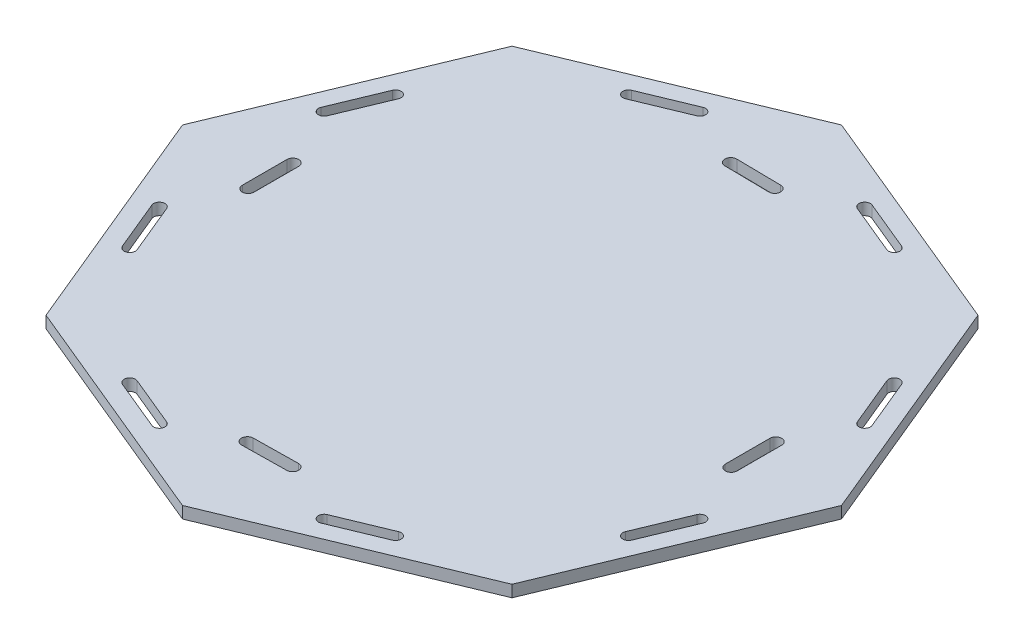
ISO-10303-21;
HEADER;
FILE_DESCRIPTION(('STEP AP214'),'2;1');
FILE_NAME('part.step','',(''),(''),'','','');
FILE_SCHEMA(('AUTOMOTIVE_DESIGN { 1 0 10303 214 1 1 1 1 }'));
ENDSEC;
DATA;
#1=APPLICATION_CONTEXT('core data for automotive mechanical design processes');
#2=APPLICATION_PROTOCOL_DEFINITION('international standard','automotive_design',2000,#1);
#3=PRODUCT_CONTEXT('',#1,'mechanical');
#4=PRODUCT('Part','Part','',(#3));
#5=PRODUCT_RELATED_PRODUCT_CATEGORY('part','',(#4));
#6=PRODUCT_DEFINITION_FORMATION('','',#4);
#7=PRODUCT_DEFINITION_CONTEXT('part definition',#1,'design');
#8=PRODUCT_DEFINITION('design','',#6,#7);
#9=PRODUCT_DEFINITION_SHAPE('','',#8);
#10=(LENGTH_UNIT() NAMED_UNIT(*) SI_UNIT(.MILLI.,.METRE.));
#11=(NAMED_UNIT(*) PLANE_ANGLE_UNIT() SI_UNIT($,.RADIAN.));
#12=(NAMED_UNIT(*) SI_UNIT($,.STERADIAN.) SOLID_ANGLE_UNIT());
#13=UNCERTAINTY_MEASURE_WITH_UNIT(LENGTH_MEASURE(1.E-05),#10,'distance_accuracy_value','');
#14=(GEOMETRIC_REPRESENTATION_CONTEXT(3) GLOBAL_UNCERTAINTY_ASSIGNED_CONTEXT((#13)) GLOBAL_UNIT_ASSIGNED_CONTEXT((#10,
#11,#12)) REPRESENTATION_CONTEXT('',''));
#15=CARTESIAN_POINT('',(0.,0.,0.));
#16=DIRECTION('',(0.,0.,1.));
#17=DIRECTION('',(1.,0.,0.));
#18=AXIS2_PLACEMENT_3D('',#15,#16,#17);
#19=CARTESIAN_POINT('',(0.,12.5,0.));
#20=DIRECTION('',(0.,1.,0.));
#21=DIRECTION('',(0.,0.,1.));
#22=AXIS2_PLACEMENT_3D('',#19,#20,#21);
#23=PLANE('',#22);
#24=DIRECTION('',(-0.923879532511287,0.,-0.382683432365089));
#25=VECTOR('',#24,1.);
#26=CARTESIAN_POINT('',(247.487373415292,12.5,-247.487373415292));
#27=LINE('',#26,#25);
#28=CARTESIAN_POINT('',(247.487373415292,12.5,-247.487373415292));
#29=VERTEX_POINT('',#28);
#30=CARTESIAN_POINT('',(0.,12.5,-350.));
#31=VERTEX_POINT('',#30);
#32=EDGE_CURVE('E763',#29,#31,#27,.T.);
#33=ORIENTED_EDGE('',*,*,#32,.T.);
#34=DIRECTION('',(-0.923879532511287,0.,0.38268343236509));
#35=VECTOR('',#34,1.);
#36=CARTESIAN_POINT('',(0.,12.5,-350.));
#37=LINE('',#36,#35);
#38=CARTESIAN_POINT('',(-247.487373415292,12.5,-247.487373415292));
#39=VERTEX_POINT('',#38);
#40=EDGE_CURVE('E766',#31,#39,#37,.T.);
#41=ORIENTED_EDGE('',*,*,#40,.T.);
#42=DIRECTION('',(-0.38268343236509,0.,0.923879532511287));
#43=VECTOR('',#42,1.);
#44=CARTESIAN_POINT('',(-247.487373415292,12.5,-247.487373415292));
#45=LINE('',#44,#43);
#46=CARTESIAN_POINT('',(-350.,12.5,0.));
#47=VERTEX_POINT('',#46);
#48=EDGE_CURVE('E769',#39,#47,#45,.T.);
#49=ORIENTED_EDGE('',*,*,#48,.T.);
#50=DIRECTION('',(0.38268343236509,0.,0.923879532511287));
#51=VECTOR('',#50,1.);
#52=CARTESIAN_POINT('',(-350.,12.5,0.));
#53=LINE('',#52,#51);
#54=CARTESIAN_POINT('',(-247.487373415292,12.5,247.487373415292));
#55=VERTEX_POINT('',#54);
#56=EDGE_CURVE('E771',#47,#55,#53,.T.);
#57=ORIENTED_EDGE('',*,*,#56,.T.);
#58=DIRECTION('',(0.923879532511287,0.,0.38268343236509));
#59=VECTOR('',#58,1.);
#60=CARTESIAN_POINT('',(-247.487373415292,12.5,247.487373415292));
#61=LINE('',#60,#59);
#62=CARTESIAN_POINT('',(0.,12.5,350.));
#63=VERTEX_POINT('',#62);
#64=EDGE_CURVE('E773',#55,#63,#61,.T.);
#65=ORIENTED_EDGE('',*,*,#64,.T.);
#66=DIRECTION('',(0.923879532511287,0.,-0.38268343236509));
#67=VECTOR('',#66,1.);
#68=CARTESIAN_POINT('',(0.,12.5,350.));
#69=LINE('',#68,#67);
#70=CARTESIAN_POINT('',(247.487373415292,12.5,247.487373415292));
#71=VERTEX_POINT('',#70);
#72=EDGE_CURVE('E775',#63,#71,#69,.T.);
#73=ORIENTED_EDGE('',*,*,#72,.T.);
#74=DIRECTION('',(0.38268343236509,0.,-0.923879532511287));
#75=VECTOR('',#74,1.);
#76=CARTESIAN_POINT('',(247.487373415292,12.5,247.487373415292));
#77=LINE('',#76,#75);
#78=CARTESIAN_POINT('',(350.,12.5,0.));
#79=VERTEX_POINT('',#78);
#80=EDGE_CURVE('E777',#71,#79,#77,.T.);
#81=ORIENTED_EDGE('',*,*,#80,.T.);
#82=DIRECTION('',(-0.38268343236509,0.,-0.923879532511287));
#83=VECTOR('',#82,1.);
#84=CARTESIAN_POINT('',(350.,12.5,0.));
#85=LINE('',#84,#83);
#86=EDGE_CURVE('E779',#79,#29,#85,.T.);
#87=ORIENTED_EDGE('',*,*,#86,.T.);
#88=EDGE_LOOP('',(#33,#41,#49,#57,#65,#73,#81,#87));
#89=FACE_BOUND('',#88,.T.);
#90=DIRECTION('',(0.999886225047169,0.,0.0150843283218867));
#91=VECTOR('',#90,1.);
#92=CARTESIAN_POINT('',(-24.4559389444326,12.5,-250.438761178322));
#93=LINE('',#92,#91);
#94=CARTESIAN_POINT('',(-24.4559389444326,12.5,-250.438761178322));
#95=VERTEX_POINT('',#94);
#96=CARTESIAN_POINT('',(22.9386681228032,12.5,-249.723764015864));
#97=VERTEX_POINT('',#96);
#98=EDGE_CURVE('E734',#95,#97,#93,.T.);
#99=ORIENTED_EDGE('',*,*,#98,.F.);
#100=CARTESIAN_POINT('',(-24.3609076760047,12.5,-256.738044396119));
#101=DIRECTION('',(0.,1.,0.));
#102=DIRECTION('',(0.,0.,1.));
#103=AXIS2_PLACEMENT_3D('',#100,#101,#102);
#104=CIRCLE('',#103,6.30000000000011);
#105=CARTESIAN_POINT('',(-24.2658764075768,12.5,-263.037327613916));
#106=VERTEX_POINT('',#105);
#107=EDGE_CURVE('E732',#106,#95,#104,.T.);
#108=ORIENTED_EDGE('',*,*,#107,.F.);
#109=DIRECTION('',(-0.999886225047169,0.,-0.0150843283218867));
#110=VECTOR('',#109,1.);
#111=CARTESIAN_POINT('',(-24.2658764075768,12.5,-263.037327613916));
#112=LINE('',#111,#110);
#113=CARTESIAN_POINT('',(23.128730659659,12.5,-262.322330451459));
#114=VERTEX_POINT('',#113);
#115=EDGE_CURVE('E740',#114,#106,#112,.T.);
#116=ORIENTED_EDGE('',*,*,#115,.F.);
#117=CARTESIAN_POINT('',(23.0336993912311,12.5,-256.023047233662));
#118=DIRECTION('',(0.,1.,0.));
#119=DIRECTION('',(0.,0.,1.));
#120=AXIS2_PLACEMENT_3D('',#117,#118,#119);
#121=CIRCLE('',#120,6.30000000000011);
#122=EDGE_CURVE('E737',#97,#114,#121,.T.);
#123=ORIENTED_EDGE('',*,*,#122,.F.);
#124=EDGE_LOOP('',(#99,#108,#116,#123));
#125=FACE_BOUND('',#124,.T.);
#126=DIRECTION('',(0.,0.,-1.));
#127=VECTOR('',#126,1.);
#128=CARTESIAN_POINT('',(-250.203877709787,12.5,23.6999999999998));
#129=LINE('',#128,#127);
#130=CARTESIAN_POINT('',(-250.203877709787,12.5,23.6999999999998));
#131=VERTEX_POINT('',#130);
#132=CARTESIAN_POINT('',(-250.203877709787,12.5,-23.7000000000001));
#133=VERTEX_POINT('',#132);
#134=EDGE_CURVE('E703',#131,#133,#129,.T.);
#135=ORIENTED_EDGE('',*,*,#134,.F.);
#136=CARTESIAN_POINT('',(-256.503877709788,12.5,23.6999999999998));
#137=DIRECTION('',(0.,1.,0.));
#138=DIRECTION('',(0.,0.,1.));
#139=AXIS2_PLACEMENT_3D('',#136,#137,#138);
#140=CIRCLE('',#139,6.30000000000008);
#141=CARTESIAN_POINT('',(-262.803877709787,12.5,23.6999999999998));
#142=VERTEX_POINT('',#141);
#143=EDGE_CURVE('E701',#142,#131,#140,.T.);
#144=ORIENTED_EDGE('',*,*,#143,.F.);
#145=DIRECTION('',(0.,0.,1.));
#146=VECTOR('',#145,1.);
#147=CARTESIAN_POINT('',(-262.803877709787,12.5,23.6999999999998));
#148=LINE('',#147,#146);
#149=CARTESIAN_POINT('',(-262.803877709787,12.5,-23.7000000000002));
#150=VERTEX_POINT('',#149);
#151=EDGE_CURVE('E709',#150,#142,#148,.T.);
#152=ORIENTED_EDGE('',*,*,#151,.F.);
#153=CARTESIAN_POINT('',(-256.503877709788,12.5,-23.7000000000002));
#154=DIRECTION('',(0.,1.,0.));
#155=DIRECTION('',(0.,0.,1.));
#156=AXIS2_PLACEMENT_3D('',#153,#154,#155);
#157=CIRCLE('',#156,6.30000000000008);
#158=EDGE_CURVE('E706',#133,#150,#157,.T.);
#159=ORIENTED_EDGE('',*,*,#158,.F.);
#160=EDGE_LOOP('',(#135,#144,#152,#159));
#161=FACE_BOUND('',#160,.T.);
#162=DIRECTION('',(0.,0.,-1.));
#163=VECTOR('',#162,1.);
#164=CARTESIAN_POINT('',(262.803877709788,12.5,23.6999999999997));
#165=LINE('',#164,#163);
#166=CARTESIAN_POINT('',(262.803877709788,12.5,23.6999999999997));
#167=VERTEX_POINT('',#166);
#168=CARTESIAN_POINT('',(262.803877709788,12.5,-23.7000000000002));
#169=VERTEX_POINT('',#168);
#170=EDGE_CURVE('E672',#167,#169,#165,.T.);
#171=ORIENTED_EDGE('',*,*,#170,.F.);
#172=CARTESIAN_POINT('',(256.503877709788,12.5,23.6999999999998));
#173=DIRECTION('',(0.,1.,0.));
#174=DIRECTION('',(0.,0.,-1.));
#175=AXIS2_PLACEMENT_3D('',#172,#173,#174);
#176=CIRCLE('',#175,6.30000000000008);
#177=CARTESIAN_POINT('',(250.203877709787,12.5,23.6999999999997));
#178=VERTEX_POINT('',#177);
#179=EDGE_CURVE('E670',#178,#167,#176,.T.);
#180=ORIENTED_EDGE('',*,*,#179,.F.);
#181=DIRECTION('',(0.,0.,1.));
#182=VECTOR('',#181,1.);
#183=CARTESIAN_POINT('',(250.203877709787,12.5,23.6999999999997));
#184=LINE('',#183,#182);
#185=CARTESIAN_POINT('',(250.203877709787,12.5,-23.7000000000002));
#186=VERTEX_POINT('',#185);
#187=EDGE_CURVE('E678',#186,#178,#184,.T.);
#188=ORIENTED_EDGE('',*,*,#187,.F.);
#189=CARTESIAN_POINT('',(256.503877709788,12.5,-23.7000000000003));
#190=DIRECTION('',(0.,1.,0.));
#191=DIRECTION('',(0.,0.,-1.));
#192=AXIS2_PLACEMENT_3D('',#189,#190,#191);
#193=CIRCLE('',#192,6.30000000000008);
#194=EDGE_CURVE('E675',#169,#186,#193,.T.);
#195=ORIENTED_EDGE('',*,*,#194,.F.);
#196=EDGE_LOOP('',(#171,#180,#188,#195));
#197=FACE_BOUND('',#196,.T.);
#198=DIRECTION('',(-0.923879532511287,0.,-0.38268343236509));
#199=VECTOR('',#198,1.);
#200=CARTESIAN_POINT('',(143.412866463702,12.5,-270.448635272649));
#201=LINE('',#200,#199);
#202=CARTESIAN_POINT('',(143.412866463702,12.5,-270.448635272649));
#203=VERTEX_POINT('',#202);
#204=CARTESIAN_POINT('',(89.8278535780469,12.5,-292.644274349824));
#205=VERTEX_POINT('',#204);
#206=EDGE_CURVE('E641',#203,#205,#201,.T.);
#207=ORIENTED_EDGE('',*,*,#206,.F.);
#208=CARTESIAN_POINT('',(141.116765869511,12.5,-264.905358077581));
#209=DIRECTION('',(0.,1.,0.));
#210=DIRECTION('',(0.,0.,1.));
#211=AXIS2_PLACEMENT_3D('',#208,#209,#210);
#212=CIRCLE('',#211,6.00000000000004);
#213=CARTESIAN_POINT('',(138.820665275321,12.5,-259.362080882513));
#214=VERTEX_POINT('',#213);
#215=EDGE_CURVE('E639',#214,#203,#212,.T.);
#216=ORIENTED_EDGE('',*,*,#215,.F.);
#217=DIRECTION('',(0.923879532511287,0.,0.38268343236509));
#218=VECTOR('',#217,1.);
#219=CARTESIAN_POINT('',(138.820665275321,12.5,-259.362080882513));
#220=LINE('',#219,#218);
#221=CARTESIAN_POINT('',(85.2356523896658,12.5,-281.557719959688));
#222=VERTEX_POINT('',#221);
#223=EDGE_CURVE('E647',#222,#214,#220,.T.);
#224=ORIENTED_EDGE('',*,*,#223,.F.);
#225=CARTESIAN_POINT('',(87.5317529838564,12.5,-287.100997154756));
#226=DIRECTION('',(0.,1.,0.));
#227=DIRECTION('',(0.,0.,1.));
#228=AXIS2_PLACEMENT_3D('',#225,#226,#227);
#229=CIRCLE('',#228,6.00000000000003);
#230=EDGE_CURVE('E644',#205,#222,#229,.T.);
#231=ORIENTED_EDGE('',*,*,#230,.F.);
#232=EDGE_LOOP('',(#207,#216,#224,#231));
#233=FACE_BOUND('',#232,.T.);
#234=DIRECTION('',(-0.382683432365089,0.,-0.923879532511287));
#235=VECTOR('',#234,1.);
#236=CARTESIAN_POINT('',(292.644274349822,12.5,-89.8278535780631));
#237=LINE('',#236,#235);
#238=CARTESIAN_POINT('',(292.644274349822,12.5,-89.8278535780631));
#239=VERTEX_POINT('',#238);
#240=CARTESIAN_POINT('',(270.448635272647,12.5,-143.412866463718));
#241=VERTEX_POINT('',#240);
#242=EDGE_CURVE('E610',#239,#241,#237,.T.);
#243=ORIENTED_EDGE('',*,*,#242,.F.);
#244=CARTESIAN_POINT('',(287.100997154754,12.5,-87.5317529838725));
#245=DIRECTION('',(0.,1.,0.));
#246=DIRECTION('',(0.,0.,1.));
#247=AXIS2_PLACEMENT_3D('',#244,#245,#246);
#248=CIRCLE('',#247,6.00000000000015);
#249=CARTESIAN_POINT('',(281.557719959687,12.5,-85.2356523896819));
#250=VERTEX_POINT('',#249);
#251=EDGE_CURVE('E608',#250,#239,#248,.T.);
#252=ORIENTED_EDGE('',*,*,#251,.F.);
#253=DIRECTION('',(0.38268343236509,0.,0.923879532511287));
#254=VECTOR('',#253,1.);
#255=CARTESIAN_POINT('',(281.557719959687,12.5,-85.2356523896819));
#256=LINE('',#255,#254);
#257=CARTESIAN_POINT('',(259.362080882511,12.5,-138.820665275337));
#258=VERTEX_POINT('',#257);
#259=EDGE_CURVE('E616',#258,#250,#256,.T.);
#260=ORIENTED_EDGE('',*,*,#259,.F.);
#261=CARTESIAN_POINT('',(264.905358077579,12.5,-141.116765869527));
#262=DIRECTION('',(0.,1.,0.));
#263=DIRECTION('',(0.,0.,1.));
#264=AXIS2_PLACEMENT_3D('',#261,#262,#263);
#265=CIRCLE('',#264,6.00000000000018);
#266=EDGE_CURVE('E613',#241,#258,#265,.T.);
#267=ORIENTED_EDGE('',*,*,#266,.F.);
#268=EDGE_LOOP('',(#243,#252,#260,#267));
#269=FACE_BOUND('',#268,.T.);
#270=DIRECTION('',(-0.923879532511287,0.,0.382683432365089));
#271=VECTOR('',#270,1.);
#272=CARTESIAN_POINT('',(-89.8278535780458,12.5,-292.644274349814));
#273=LINE('',#272,#271);
#274=CARTESIAN_POINT('',(-89.8278535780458,12.5,-292.644274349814));
#275=VERTEX_POINT('',#274);
#276=CARTESIAN_POINT('',(-143.412866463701,12.5,-270.448635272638));
#277=VERTEX_POINT('',#276);
#278=EDGE_CURVE('E579',#275,#277,#273,.T.);
#279=ORIENTED_EDGE('',*,*,#278,.F.);
#280=CARTESIAN_POINT('',(-87.5317529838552,12.5,-287.100997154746));
#281=DIRECTION('',(0.,1.,0.));
#282=DIRECTION('',(0.,0.,1.));
#283=AXIS2_PLACEMENT_3D('',#280,#281,#282);
#284=CIRCLE('',#283,6.00000000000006);
#285=CARTESIAN_POINT('',(-85.2356523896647,12.5,-281.557719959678));
#286=VERTEX_POINT('',#285);
#287=EDGE_CURVE('E577',#286,#275,#284,.T.);
#288=ORIENTED_EDGE('',*,*,#287,.F.);
#289=DIRECTION('',(0.923879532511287,0.,-0.382683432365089));
#290=VECTOR('',#289,1.);
#291=CARTESIAN_POINT('',(-85.2356523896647,12.5,-281.557719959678));
#292=LINE('',#291,#290);
#293=CARTESIAN_POINT('',(-138.82066527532,12.5,-259.362080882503));
#294=VERTEX_POINT('',#293);
#295=EDGE_CURVE('E585',#294,#286,#292,.T.);
#296=ORIENTED_EDGE('',*,*,#295,.F.);
#297=CARTESIAN_POINT('',(-141.11676586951,12.5,-264.90535807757));
#298=DIRECTION('',(0.,1.,0.));
#299=DIRECTION('',(0.,0.,1.));
#300=AXIS2_PLACEMENT_3D('',#297,#298,#299);
#301=CIRCLE('',#300,6.00000000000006);
#302=EDGE_CURVE('E582',#277,#294,#301,.T.);
#303=ORIENTED_EDGE('',*,*,#302,.F.);
#304=EDGE_LOOP('',(#279,#288,#296,#303));
#305=FACE_BOUND('',#304,.T.);
#306=DIRECTION('',(0.38268343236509,0.,-0.923879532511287));
#307=VECTOR('',#306,1.);
#308=CARTESIAN_POINT('',(270.448635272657,12.5,143.412866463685));
#309=LINE('',#308,#307);
#310=CARTESIAN_POINT('',(270.448635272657,12.5,143.412866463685));
#311=VERTEX_POINT('',#310);
#312=CARTESIAN_POINT('',(292.644274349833,12.5,89.8278535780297));
#313=VERTEX_POINT('',#312);
#314=EDGE_CURVE('E548',#311,#313,#309,.T.);
#315=ORIENTED_EDGE('',*,*,#314,.F.);
#316=CARTESIAN_POINT('',(264.905358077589,12.5,141.116765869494));
#317=DIRECTION('',(0.,1.,0.));
#318=DIRECTION('',(0.,0.,1.));
#319=AXIS2_PLACEMENT_3D('',#316,#317,#318);
#320=CIRCLE('',#319,6.00000000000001);
#321=CARTESIAN_POINT('',(259.362080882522,12.5,138.820665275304));
#322=VERTEX_POINT('',#321);
#323=EDGE_CURVE('E546',#322,#311,#320,.T.);
#324=ORIENTED_EDGE('',*,*,#323,.F.);
#325=DIRECTION('',(-0.38268343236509,0.,0.923879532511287));
#326=VECTOR('',#325,1.);
#327=CARTESIAN_POINT('',(259.362080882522,12.5,138.820665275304));
#328=LINE('',#327,#326);
#329=CARTESIAN_POINT('',(281.557719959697,12.5,85.2356523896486));
#330=VERTEX_POINT('',#329);
#331=EDGE_CURVE('E554',#330,#322,#328,.T.);
#332=ORIENTED_EDGE('',*,*,#331,.F.);
#333=CARTESIAN_POINT('',(287.100997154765,12.5,87.5317529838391));
#334=DIRECTION('',(0.,1.,0.));
#335=DIRECTION('',(0.,0.,1.));
#336=AXIS2_PLACEMENT_3D('',#333,#334,#335);
#337=CIRCLE('',#336,6.00000000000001);
#338=EDGE_CURVE('E551',#313,#330,#337,.T.);
#339=ORIENTED_EDGE('',*,*,#338,.F.);
#340=EDGE_LOOP('',(#315,#324,#332,#339));
#341=FACE_BOUND('',#340,.T.);
#342=DIRECTION('',(0.923879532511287,0.,-0.38268343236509));
#343=VECTOR('',#342,1.);
#344=CARTESIAN_POINT('',(89.8278535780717,12.5,292.644274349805));
#345=LINE('',#344,#343);
#346=CARTESIAN_POINT('',(89.8278535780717,12.5,292.644274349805));
#347=VERTEX_POINT('',#346);
#348=CARTESIAN_POINT('',(143.412866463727,12.5,270.44863527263));
#349=VERTEX_POINT('',#348);
#350=EDGE_CURVE('E517',#347,#349,#345,.T.);
#351=ORIENTED_EDGE('',*,*,#350,.F.);
#352=CARTESIAN_POINT('',(87.5317529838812,12.5,287.100997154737));
#353=DIRECTION('',(0.,1.,0.));
#354=DIRECTION('',(0.,0.,1.));
#355=AXIS2_PLACEMENT_3D('',#352,#353,#354);
#356=CIRCLE('',#355,5.99999999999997);
#357=CARTESIAN_POINT('',(85.2356523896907,12.5,281.55771995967));
#358=VERTEX_POINT('',#357);
#359=EDGE_CURVE('E515',#358,#347,#356,.T.);
#360=ORIENTED_EDGE('',*,*,#359,.F.);
#361=DIRECTION('',(-0.923879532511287,0.,0.382683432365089));
#362=VECTOR('',#361,1.);
#363=CARTESIAN_POINT('',(85.2356523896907,12.5,281.55771995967));
#364=LINE('',#363,#362);
#365=CARTESIAN_POINT('',(138.820665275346,12.5,259.362080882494));
#366=VERTEX_POINT('',#365);
#367=EDGE_CURVE('E523',#366,#358,#364,.T.);
#368=ORIENTED_EDGE('',*,*,#367,.F.);
#369=CARTESIAN_POINT('',(141.116765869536,12.5,264.905358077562));
#370=DIRECTION('',(0.,1.,0.));
#371=DIRECTION('',(0.,0.,1.));
#372=AXIS2_PLACEMENT_3D('',#369,#370,#371);
#373=CIRCLE('',#372,5.99999999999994);
#374=EDGE_CURVE('E520',#349,#366,#373,.T.);
#375=ORIENTED_EDGE('',*,*,#374,.F.);
#376=EDGE_LOOP('',(#351,#360,#368,#375));
#377=FACE_BOUND('',#376,.T.);
#378=DIRECTION('',(0.923879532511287,0.,0.38268343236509));
#379=VECTOR('',#378,1.);
#380=CARTESIAN_POINT('',(-143.412866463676,12.5,270.44863527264));
#381=LINE('',#380,#379);
#382=CARTESIAN_POINT('',(-143.412866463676,12.5,270.44863527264));
#383=VERTEX_POINT('',#382);
#384=CARTESIAN_POINT('',(-89.827853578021,12.5,292.644274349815));
#385=VERTEX_POINT('',#384);
#386=EDGE_CURVE('E486',#383,#385,#381,.T.);
#387=ORIENTED_EDGE('',*,*,#386,.F.);
#388=CARTESIAN_POINT('',(-141.116765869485,12.5,264.905358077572));
#389=DIRECTION('',(0.,1.,0.));
#390=DIRECTION('',(0.,0.,1.));
#391=AXIS2_PLACEMENT_3D('',#388,#389,#390);
#392=CIRCLE('',#391,6.0000000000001);
#393=CARTESIAN_POINT('',(-138.820665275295,12.5,259.362080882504));
#394=VERTEX_POINT('',#393);
#395=EDGE_CURVE('E484',#394,#383,#392,.T.);
#396=ORIENTED_EDGE('',*,*,#395,.F.);
#397=DIRECTION('',(-0.923879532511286,0.,-0.382683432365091));
#398=VECTOR('',#397,1.);
#399=CARTESIAN_POINT('',(-138.820665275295,12.5,259.362080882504));
#400=LINE('',#399,#398);
#401=CARTESIAN_POINT('',(-85.2356523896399,12.5,281.55771995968));
#402=VERTEX_POINT('',#401);
#403=EDGE_CURVE('E492',#402,#394,#400,.T.);
#404=ORIENTED_EDGE('',*,*,#403,.F.);
#405=CARTESIAN_POINT('',(-87.5317529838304,12.5,287.100997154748));
#406=DIRECTION('',(0.,1.,0.));
#407=DIRECTION('',(0.,0.,1.));
#408=AXIS2_PLACEMENT_3D('',#405,#406,#407);
#409=CIRCLE('',#408,6.00000000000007);
#410=EDGE_CURVE('E489',#385,#402,#409,.T.);
#411=ORIENTED_EDGE('',*,*,#410,.F.);
#412=EDGE_LOOP('',(#387,#396,#404,#411));
#413=FACE_BOUND('',#412,.T.);
#414=DIRECTION('',(0.382683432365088,0.,0.923879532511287));
#415=VECTOR('',#414,1.);
#416=CARTESIAN_POINT('',(-292.644274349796,12.5,89.8278535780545));
#417=LINE('',#416,#415);
#418=CARTESIAN_POINT('',(-292.644274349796,12.5,89.8278535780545));
#419=VERTEX_POINT('',#418);
#420=CARTESIAN_POINT('',(-270.448635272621,12.5,143.41286646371));
#421=VERTEX_POINT('',#420);
#422=EDGE_CURVE('E455',#419,#421,#417,.T.);
#423=ORIENTED_EDGE('',*,*,#422,.F.);
#424=CARTESIAN_POINT('',(-287.100997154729,12.5,87.531752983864));
#425=DIRECTION('',(0.,1.,0.));
#426=DIRECTION('',(0.,0.,1.));
#427=AXIS2_PLACEMENT_3D('',#424,#425,#426);
#428=CIRCLE('',#427,6.);
#429=CARTESIAN_POINT('',(-281.557719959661,12.5,85.2356523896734));
#430=VERTEX_POINT('',#429);
#431=EDGE_CURVE('E453',#430,#419,#428,.T.);
#432=ORIENTED_EDGE('',*,*,#431,.F.);
#433=DIRECTION('',(-0.382683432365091,0.,-0.923879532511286));
#434=VECTOR('',#433,1.);
#435=CARTESIAN_POINT('',(-281.557719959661,12.5,85.2356523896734));
#436=LINE('',#435,#434);
#437=CARTESIAN_POINT('',(-259.362080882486,12.5,138.820665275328));
#438=VERTEX_POINT('',#437);
#439=EDGE_CURVE('E461',#438,#430,#436,.T.);
#440=ORIENTED_EDGE('',*,*,#439,.F.);
#441=CARTESIAN_POINT('',(-264.905358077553,12.5,141.116765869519));
#442=DIRECTION('',(0.,1.,0.));
#443=DIRECTION('',(0.,0.,1.));
#444=AXIS2_PLACEMENT_3D('',#441,#442,#443);
#445=CIRCLE('',#444,6.0000000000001);
#446=EDGE_CURVE('E458',#421,#438,#445,.T.);
#447=ORIENTED_EDGE('',*,*,#446,.F.);
#448=EDGE_LOOP('',(#423,#432,#440,#447));
#449=FACE_BOUND('',#448,.T.);
#450=DIRECTION('',(0.999886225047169,0.,-0.0150843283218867));
#451=VECTOR('',#450,1.);
#452=CARTESIAN_POINT('',(-24.2658764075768,12.5,263.037327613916));
#453=LINE('',#452,#451);
#454=CARTESIAN_POINT('',(-24.2658764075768,12.5,263.037327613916));
#455=VERTEX_POINT('',#454);
#456=CARTESIAN_POINT('',(23.128730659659,12.5,262.322330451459));
#457=VERTEX_POINT('',#456);
#458=EDGE_CURVE('E424',#455,#457,#453,.T.);
#459=ORIENTED_EDGE('',*,*,#458,.F.);
#460=CARTESIAN_POINT('',(-24.3609076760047,12.5,256.738044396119));
#461=DIRECTION('',(0.,1.,0.));
#462=DIRECTION('',(0.,0.,-1.));
#463=AXIS2_PLACEMENT_3D('',#460,#461,#462);
#464=CIRCLE('',#463,6.30000000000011);
#465=CARTESIAN_POINT('',(-24.4559389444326,12.5,250.438761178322));
#466=VERTEX_POINT('',#465);
#467=EDGE_CURVE('E422',#466,#455,#464,.T.);
#468=ORIENTED_EDGE('',*,*,#467,.F.);
#469=DIRECTION('',(-0.999886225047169,0.,0.0150843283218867));
#470=VECTOR('',#469,1.);
#471=CARTESIAN_POINT('',(-24.4559389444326,12.5,250.438761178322));
#472=LINE('',#471,#470);
#473=CARTESIAN_POINT('',(22.9386681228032,12.5,249.723764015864));
#474=VERTEX_POINT('',#473);
#475=EDGE_CURVE('E430',#474,#466,#472,.T.);
#476=ORIENTED_EDGE('',*,*,#475,.F.);
#477=CARTESIAN_POINT('',(23.0336993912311,12.5,256.023047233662));
#478=DIRECTION('',(0.,1.,0.));
#479=DIRECTION('',(0.,0.,-1.));
#480=AXIS2_PLACEMENT_3D('',#477,#478,#479);
#481=CIRCLE('',#480,6.30000000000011);
#482=EDGE_CURVE('E427',#457,#474,#481,.T.);
#483=ORIENTED_EDGE('',*,*,#482,.F.);
#484=EDGE_LOOP('',(#459,#468,#476,#483));
#485=FACE_BOUND('',#484,.T.);
#486=DIRECTION('',(-0.38268343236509,0.,0.923879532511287));
#487=VECTOR('',#486,1.);
#488=CARTESIAN_POINT('',(-270.448635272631,12.5,-143.412866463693));
#489=LINE('',#488,#487);
#490=CARTESIAN_POINT('',(-270.448635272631,12.5,-143.412866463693));
#491=VERTEX_POINT('',#490);
#492=CARTESIAN_POINT('',(-292.644274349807,12.5,-89.8278535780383));
#493=VERTEX_POINT('',#492);
#494=EDGE_CURVE('E394',#491,#493,#489,.T.);
#495=ORIENTED_EDGE('',*,*,#494,.F.);
#496=CARTESIAN_POINT('',(-264.905358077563,12.5,-141.116765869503));
#497=DIRECTION('',(0.,1.,0.));
#498=DIRECTION('',(0.,0.,1.));
#499=AXIS2_PLACEMENT_3D('',#496,#497,#498);
#500=CIRCLE('',#499,6.00000000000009);
#501=CARTESIAN_POINT('',(-259.362080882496,12.5,-138.820665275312));
#502=VERTEX_POINT('',#501);
#503=EDGE_CURVE('E386',#502,#491,#500,.T.);
#504=ORIENTED_EDGE('',*,*,#503,.F.);
#505=DIRECTION('',(0.38268343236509,0.,-0.923879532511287));
#506=VECTOR('',#505,1.);
#507=CARTESIAN_POINT('',(-259.362080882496,12.5,-138.820665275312));
#508=LINE('',#507,#506);
#509=CARTESIAN_POINT('',(-281.557719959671,12.5,-85.2356523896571));
#510=VERTEX_POINT('',#509);
#511=EDGE_CURVE('E408',#510,#502,#508,.T.);
#512=ORIENTED_EDGE('',*,*,#511,.F.);
#513=CARTESIAN_POINT('',(-287.100997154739,12.5,-87.5317529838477));
#514=DIRECTION('',(0.,1.,0.));
#515=DIRECTION('',(0.,0.,1.));
#516=AXIS2_PLACEMENT_3D('',#513,#514,#515);
#517=CIRCLE('',#516,6.0000000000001);
#518=EDGE_CURVE('E406',#493,#510,#517,.T.);
#519=ORIENTED_EDGE('',*,*,#518,.F.);
#520=EDGE_LOOP('',(#495,#504,#512,#519));
#521=FACE_BOUND('',#520,.T.);
#522=ADVANCED_FACE('F33',(#89,#125,#161,#197,#233,#269,#305,#341,#377,#413,#449,#485,#521),#23,.T.);
#523=CARTESIAN_POINT('',(0.,0.,0.));
#524=DIRECTION('',(0.,1.,0.));
#525=DIRECTION('',(0.,0.,1.));
#526=AXIS2_PLACEMENT_3D('',#523,#524,#525);
#527=PLANE('',#526);
#528=CARTESIAN_POINT('',(-24.3609076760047,0.,256.738044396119));
#529=DIRECTION('',(0.,1.,0.));
#530=DIRECTION('',(0.,0.,-1.));
#531=AXIS2_PLACEMENT_3D('',#528,#529,#530);
#532=CIRCLE('',#531,6.30000000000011);
#533=CARTESIAN_POINT('',(-24.4559389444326,0.,250.438761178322));
#534=VERTEX_POINT('',#533);
#535=CARTESIAN_POINT('',(-24.2658764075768,0.,263.037327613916));
#536=VERTEX_POINT('',#535);
#537=EDGE_CURVE('E402',#534,#536,#532,.T.);
#538=ORIENTED_EDGE('',*,*,#537,.T.);
#539=DIRECTION('',(0.999886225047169,0.,-0.0150843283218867));
#540=VECTOR('',#539,1.);
#541=CARTESIAN_POINT('',(-24.2658764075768,0.,263.037327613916));
#542=LINE('',#541,#540);
#543=CARTESIAN_POINT('',(23.128730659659,0.,262.322330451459));
#544=VERTEX_POINT('',#543);
#545=EDGE_CURVE('E435',#536,#544,#542,.T.);
#546=ORIENTED_EDGE('',*,*,#545,.T.);
#547=CARTESIAN_POINT('',(23.0336993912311,0.,256.023047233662));
#548=DIRECTION('',(0.,1.,0.));
#549=DIRECTION('',(0.,0.,-1.));
#550=AXIS2_PLACEMENT_3D('',#547,#548,#549);
#551=CIRCLE('',#550,6.30000000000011);
#552=CARTESIAN_POINT('',(22.9386681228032,0.,249.723764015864));
#553=VERTEX_POINT('',#552);
#554=EDGE_CURVE('E438',#544,#553,#551,.T.);
#555=ORIENTED_EDGE('',*,*,#554,.T.);
#556=DIRECTION('',(-0.999886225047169,0.,0.0150843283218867));
#557=VECTOR('',#556,1.);
#558=CARTESIAN_POINT('',(-24.4559389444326,0.,250.438761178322));
#559=LINE('',#558,#557);
#560=EDGE_CURVE('E425',#553,#534,#559,.T.);
#561=ORIENTED_EDGE('',*,*,#560,.T.);
#562=EDGE_LOOP('',(#538,#546,#555,#561));
#563=FACE_BOUND('',#562,.T.);
#564=CARTESIAN_POINT('',(-141.116765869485,0.,264.905358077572));
#565=DIRECTION('',(0.,1.,0.));
#566=DIRECTION('',(0.,0.,1.));
#567=AXIS2_PLACEMENT_3D('',#564,#565,#566);
#568=CIRCLE('',#567,6.0000000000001);
#569=CARTESIAN_POINT('',(-138.820665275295,0.,259.362080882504));
#570=VERTEX_POINT('',#569);
#571=CARTESIAN_POINT('',(-143.412866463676,0.,270.44863527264));
#572=VERTEX_POINT('',#571);
#573=EDGE_CURVE('E483',#570,#572,#568,.T.);
#574=ORIENTED_EDGE('',*,*,#573,.T.);
#575=DIRECTION('',(0.923879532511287,0.,0.38268343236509));
#576=VECTOR('',#575,1.);
#577=CARTESIAN_POINT('',(-143.412866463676,0.,270.44863527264));
#578=LINE('',#577,#576);
#579=CARTESIAN_POINT('',(-89.827853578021,0.,292.644274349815));
#580=VERTEX_POINT('',#579);
#581=EDGE_CURVE('E497',#572,#580,#578,.T.);
#582=ORIENTED_EDGE('',*,*,#581,.T.);
#583=CARTESIAN_POINT('',(-87.5317529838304,0.,287.100997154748));
#584=DIRECTION('',(0.,1.,0.));
#585=DIRECTION('',(0.,0.,1.));
#586=AXIS2_PLACEMENT_3D('',#583,#584,#585);
#587=CIRCLE('',#586,6.00000000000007);
#588=CARTESIAN_POINT('',(-85.2356523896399,0.,281.55771995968));
#589=VERTEX_POINT('',#588);
#590=EDGE_CURVE('E500',#580,#589,#587,.T.);
#591=ORIENTED_EDGE('',*,*,#590,.T.);
#592=DIRECTION('',(-0.923879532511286,0.,-0.382683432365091));
#593=VECTOR('',#592,1.);
#594=CARTESIAN_POINT('',(-138.820665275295,0.,259.362080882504));
#595=LINE('',#594,#593);
#596=EDGE_CURVE('E487',#589,#570,#595,.T.);
#597=ORIENTED_EDGE('',*,*,#596,.T.);
#598=EDGE_LOOP('',(#574,#582,#591,#597));
#599=FACE_BOUND('',#598,.T.);
#600=CARTESIAN_POINT('',(264.905358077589,0.,141.116765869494));
#601=DIRECTION('',(0.,1.,0.));
#602=DIRECTION('',(0.,0.,1.));
#603=AXIS2_PLACEMENT_3D('',#600,#601,#602);
#604=CIRCLE('',#603,6.00000000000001);
#605=CARTESIAN_POINT('',(259.362080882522,0.,138.820665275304));
#606=VERTEX_POINT('',#605);
#607=CARTESIAN_POINT('',(270.448635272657,0.,143.412866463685));
#608=VERTEX_POINT('',#607);
#609=EDGE_CURVE('E545',#606,#608,#604,.T.);
#610=ORIENTED_EDGE('',*,*,#609,.T.);
#611=DIRECTION('',(0.38268343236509,0.,-0.923879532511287));
#612=VECTOR('',#611,1.);
#613=CARTESIAN_POINT('',(270.448635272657,0.,143.412866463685));
#614=LINE('',#613,#612);
#615=CARTESIAN_POINT('',(292.644274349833,0.,89.8278535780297));
#616=VERTEX_POINT('',#615);
#617=EDGE_CURVE('E559',#608,#616,#614,.T.);
#618=ORIENTED_EDGE('',*,*,#617,.T.);
#619=CARTESIAN_POINT('',(287.100997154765,0.,87.5317529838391));
#620=DIRECTION('',(0.,1.,0.));
#621=DIRECTION('',(0.,0.,1.));
#622=AXIS2_PLACEMENT_3D('',#619,#620,#621);
#623=CIRCLE('',#622,6.00000000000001);
#624=CARTESIAN_POINT('',(281.557719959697,0.,85.2356523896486));
#625=VERTEX_POINT('',#624);
#626=EDGE_CURVE('E562',#616,#625,#623,.T.);
#627=ORIENTED_EDGE('',*,*,#626,.T.);
#628=DIRECTION('',(-0.38268343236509,0.,0.923879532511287));
#629=VECTOR('',#628,1.);
#630=CARTESIAN_POINT('',(259.362080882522,0.,138.820665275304));
#631=LINE('',#630,#629);
#632=EDGE_CURVE('E549',#625,#606,#631,.T.);
#633=ORIENTED_EDGE('',*,*,#632,.T.);
#634=EDGE_LOOP('',(#610,#618,#627,#633));
#635=FACE_BOUND('',#634,.T.);
#636=CARTESIAN_POINT('',(287.100997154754,0.,-87.5317529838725));
#637=DIRECTION('',(0.,1.,0.));
#638=DIRECTION('',(0.,0.,1.));
#639=AXIS2_PLACEMENT_3D('',#636,#637,#638);
#640=CIRCLE('',#639,6.00000000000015);
#641=CARTESIAN_POINT('',(281.557719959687,0.,-85.2356523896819));
#642=VERTEX_POINT('',#641);
#643=CARTESIAN_POINT('',(292.644274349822,0.,-89.8278535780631));
#644=VERTEX_POINT('',#643);
#645=EDGE_CURVE('E607',#642,#644,#640,.T.);
#646=ORIENTED_EDGE('',*,*,#645,.T.);
#647=DIRECTION('',(-0.382683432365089,0.,-0.923879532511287));
#648=VECTOR('',#647,1.);
#649=CARTESIAN_POINT('',(292.644274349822,0.,-89.8278535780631));
#650=LINE('',#649,#648);
#651=CARTESIAN_POINT('',(270.448635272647,0.,-143.412866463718));
#652=VERTEX_POINT('',#651);
#653=EDGE_CURVE('E621',#644,#652,#650,.T.);
#654=ORIENTED_EDGE('',*,*,#653,.T.);
#655=CARTESIAN_POINT('',(264.905358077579,0.,-141.116765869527));
#656=DIRECTION('',(0.,1.,0.));
#657=DIRECTION('',(0.,0.,1.));
#658=AXIS2_PLACEMENT_3D('',#655,#656,#657);
#659=CIRCLE('',#658,6.00000000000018);
#660=CARTESIAN_POINT('',(259.362080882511,0.,-138.820665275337));
#661=VERTEX_POINT('',#660);
#662=EDGE_CURVE('E624',#652,#661,#659,.T.);
#663=ORIENTED_EDGE('',*,*,#662,.T.);
#664=DIRECTION('',(0.38268343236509,0.,0.923879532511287));
#665=VECTOR('',#664,1.);
#666=CARTESIAN_POINT('',(281.557719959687,0.,-85.2356523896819));
#667=LINE('',#666,#665);
#668=EDGE_CURVE('E611',#661,#642,#667,.T.);
#669=ORIENTED_EDGE('',*,*,#668,.T.);
#670=EDGE_LOOP('',(#646,#654,#663,#669));
#671=FACE_BOUND('',#670,.T.);
#672=CARTESIAN_POINT('',(256.503877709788,0.,23.6999999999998));
#673=DIRECTION('',(0.,1.,0.));
#674=DIRECTION('',(0.,0.,-1.));
#675=AXIS2_PLACEMENT_3D('',#672,#673,#674);
#676=CIRCLE('',#675,6.30000000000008);
#677=CARTESIAN_POINT('',(250.203877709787,0.,23.6999999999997));
#678=VERTEX_POINT('',#677);
#679=CARTESIAN_POINT('',(262.803877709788,0.,23.6999999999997));
#680=VERTEX_POINT('',#679);
#681=EDGE_CURVE('E669',#678,#680,#676,.T.);
#682=ORIENTED_EDGE('',*,*,#681,.T.);
#683=DIRECTION('',(0.,0.,-1.));
#684=VECTOR('',#683,1.);
#685=CARTESIAN_POINT('',(262.803877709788,0.,23.6999999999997));
#686=LINE('',#685,#684);
#687=CARTESIAN_POINT('',(262.803877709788,0.,-23.7000000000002));
#688=VERTEX_POINT('',#687);
#689=EDGE_CURVE('E683',#680,#688,#686,.T.);
#690=ORIENTED_EDGE('',*,*,#689,.T.);
#691=CARTESIAN_POINT('',(256.503877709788,0.,-23.7000000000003));
#692=DIRECTION('',(0.,1.,0.));
#693=DIRECTION('',(0.,0.,-1.));
#694=AXIS2_PLACEMENT_3D('',#691,#692,#693);
#695=CIRCLE('',#694,6.30000000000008);
#696=CARTESIAN_POINT('',(250.203877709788,0.,-23.7000000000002));
#697=VERTEX_POINT('',#696);
#698=EDGE_CURVE('E686',#688,#697,#695,.T.);
#699=ORIENTED_EDGE('',*,*,#698,.T.);
#700=DIRECTION('',(0.,0.,1.));
#701=VECTOR('',#700,1.);
#702=CARTESIAN_POINT('',(250.203877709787,0.,23.6999999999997));
#703=LINE('',#702,#701);
#704=EDGE_CURVE('E673',#697,#678,#703,.T.);
#705=ORIENTED_EDGE('',*,*,#704,.T.);
#706=EDGE_LOOP('',(#682,#690,#699,#705));
#707=FACE_BOUND('',#706,.T.);
#708=CARTESIAN_POINT('',(-24.3609076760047,0.,-256.738044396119));
#709=DIRECTION('',(0.,1.,0.));
#710=DIRECTION('',(0.,0.,1.));
#711=AXIS2_PLACEMENT_3D('',#708,#709,#710);
#712=CIRCLE('',#711,6.30000000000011);
#713=CARTESIAN_POINT('',(-24.2658764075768,0.,-263.037327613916));
#714=VERTEX_POINT('',#713);
#715=CARTESIAN_POINT('',(-24.4559389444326,0.,-250.438761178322));
#716=VERTEX_POINT('',#715);
#717=EDGE_CURVE('E731',#714,#716,#712,.T.);
#718=ORIENTED_EDGE('',*,*,#717,.T.);
#719=DIRECTION('',(0.999886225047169,0.,0.0150843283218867));
#720=VECTOR('',#719,1.);
#721=CARTESIAN_POINT('',(-24.4559389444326,0.,-250.438761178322));
#722=LINE('',#721,#720);
#723=CARTESIAN_POINT('',(22.9386681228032,0.,-249.723764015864));
#724=VERTEX_POINT('',#723);
#725=EDGE_CURVE('E745',#716,#724,#722,.T.);
#726=ORIENTED_EDGE('',*,*,#725,.T.);
#727=CARTESIAN_POINT('',(23.0336993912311,0.,-256.023047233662));
#728=DIRECTION('',(0.,1.,0.));
#729=DIRECTION('',(0.,0.,1.));
#730=AXIS2_PLACEMENT_3D('',#727,#728,#729);
#731=CIRCLE('',#730,6.30000000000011);
#732=CARTESIAN_POINT('',(23.128730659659,0.,-262.322330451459));
#733=VERTEX_POINT('',#732);
#734=EDGE_CURVE('E748',#724,#733,#731,.T.);
#735=ORIENTED_EDGE('',*,*,#734,.T.);
#736=DIRECTION('',(-0.999886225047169,0.,-0.0150843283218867));
#737=VECTOR('',#736,1.);
#738=CARTESIAN_POINT('',(-24.2658764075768,0.,-263.037327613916));
#739=LINE('',#738,#737);
#740=EDGE_CURVE('E735',#733,#714,#739,.T.);
#741=ORIENTED_EDGE('',*,*,#740,.T.);
#742=EDGE_LOOP('',(#718,#726,#735,#741));
#743=FACE_BOUND('',#742,.T.);
#744=DIRECTION('',(-0.923879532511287,0.,-0.382683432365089));
#745=VECTOR('',#744,1.);
#746=CARTESIAN_POINT('',(247.487373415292,0.,-247.487373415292));
#747=LINE('',#746,#745);
#748=CARTESIAN_POINT('',(247.487373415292,0.,-247.487373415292));
#749=VERTEX_POINT('',#748);
#750=CARTESIAN_POINT('',(0.,0.,-350.));
#751=VERTEX_POINT('',#750);
#752=EDGE_CURVE('E762',#749,#751,#747,.T.);
#753=ORIENTED_EDGE('',*,*,#752,.F.);
#754=DIRECTION('',(-0.38268343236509,0.,-0.923879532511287));
#755=VECTOR('',#754,1.);
#756=CARTESIAN_POINT('',(350.,0.,0.));
#757=LINE('',#756,#755);
#758=CARTESIAN_POINT('',(350.,0.,0.));
#759=VERTEX_POINT('',#758);
#760=EDGE_CURVE('E767',#759,#749,#757,.T.);
#761=ORIENTED_EDGE('',*,*,#760,.F.);
#762=DIRECTION('',(0.38268343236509,0.,-0.923879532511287));
#763=VECTOR('',#762,1.);
#764=CARTESIAN_POINT('',(247.487373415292,0.,247.487373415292));
#765=LINE('',#764,#763);
#766=CARTESIAN_POINT('',(247.487373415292,0.,247.487373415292));
#767=VERTEX_POINT('',#766);
#768=EDGE_CURVE('E794',#767,#759,#765,.T.);
#769=ORIENTED_EDGE('',*,*,#768,.F.);
#770=DIRECTION('',(0.923879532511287,0.,-0.38268343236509));
#771=VECTOR('',#770,1.);
#772=CARTESIAN_POINT('',(0.,0.,350.));
#773=LINE('',#772,#771);
#774=CARTESIAN_POINT('',(0.,0.,350.));
#775=VERTEX_POINT('',#774);
#776=EDGE_CURVE('E792',#775,#767,#773,.T.);
#777=ORIENTED_EDGE('',*,*,#776,.F.);
#778=DIRECTION('',(0.923879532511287,0.,0.38268343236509));
#779=VECTOR('',#778,1.);
#780=CARTESIAN_POINT('',(-247.487373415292,0.,247.487373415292));
#781=LINE('',#780,#779);
#782=CARTESIAN_POINT('',(-247.487373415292,0.,247.487373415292));
#783=VERTEX_POINT('',#782);
#784=EDGE_CURVE('E790',#783,#775,#781,.T.);
#785=ORIENTED_EDGE('',*,*,#784,.F.);
#786=DIRECTION('',(0.38268343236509,0.,0.923879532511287));
#787=VECTOR('',#786,1.);
#788=CARTESIAN_POINT('',(-350.,0.,0.));
#789=LINE('',#788,#787);
#790=CARTESIAN_POINT('',(-350.,0.,0.));
#791=VERTEX_POINT('',#790);
#792=EDGE_CURVE('E788',#791,#783,#789,.T.);
#793=ORIENTED_EDGE('',*,*,#792,.F.);
#794=DIRECTION('',(-0.38268343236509,0.,0.923879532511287));
#795=VECTOR('',#794,1.);
#796=CARTESIAN_POINT('',(-247.487373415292,0.,-247.487373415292));
#797=LINE('',#796,#795);
#798=CARTESIAN_POINT('',(-247.487373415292,0.,-247.487373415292));
#799=VERTEX_POINT('',#798);
#800=EDGE_CURVE('E786',#799,#791,#797,.T.);
#801=ORIENTED_EDGE('',*,*,#800,.F.);
#802=DIRECTION('',(-0.923879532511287,0.,0.38268343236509));
#803=VECTOR('',#802,1.);
#804=CARTESIAN_POINT('',(0.,0.,-350.));
#805=LINE('',#804,#803);
#806=EDGE_CURVE('E784',#751,#799,#805,.T.);
#807=ORIENTED_EDGE('',*,*,#806,.F.);
#808=EDGE_LOOP('',(#753,#761,#769,#777,#785,#793,#801,#807));
#809=FACE_BOUND('',#808,.T.);
#810=CARTESIAN_POINT('',(-256.503877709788,0.,23.6999999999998));
#811=DIRECTION('',(0.,1.,0.));
#812=DIRECTION('',(0.,0.,1.));
#813=AXIS2_PLACEMENT_3D('',#810,#811,#812);
#814=CIRCLE('',#813,6.30000000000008);
#815=CARTESIAN_POINT('',(-262.803877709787,0.,23.6999999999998));
#816=VERTEX_POINT('',#815);
#817=CARTESIAN_POINT('',(-250.203877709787,0.,23.6999999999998));
#818=VERTEX_POINT('',#817);
#819=EDGE_CURVE('E700',#816,#818,#814,.T.);
#820=ORIENTED_EDGE('',*,*,#819,.T.);
#821=DIRECTION('',(0.,0.,-1.));
#822=VECTOR('',#821,1.);
#823=CARTESIAN_POINT('',(-250.203877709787,0.,23.6999999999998));
#824=LINE('',#823,#822);
#825=CARTESIAN_POINT('',(-250.203877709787,0.,-23.7000000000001));
#826=VERTEX_POINT('',#825);
#827=EDGE_CURVE('E714',#818,#826,#824,.T.);
#828=ORIENTED_EDGE('',*,*,#827,.T.);
#829=CARTESIAN_POINT('',(-256.503877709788,0.,-23.7000000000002));
#830=DIRECTION('',(0.,1.,0.));
#831=DIRECTION('',(0.,0.,1.));
#832=AXIS2_PLACEMENT_3D('',#829,#830,#831);
#833=CIRCLE('',#832,6.30000000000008);
#834=CARTESIAN_POINT('',(-262.803877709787,0.,-23.7000000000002));
#835=VERTEX_POINT('',#834);
#836=EDGE_CURVE('E717',#826,#835,#833,.T.);
#837=ORIENTED_EDGE('',*,*,#836,.T.);
#838=DIRECTION('',(0.,0.,1.));
#839=VECTOR('',#838,1.);
#840=CARTESIAN_POINT('',(-262.803877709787,0.,23.6999999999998));
#841=LINE('',#840,#839);
#842=EDGE_CURVE('E704',#835,#816,#841,.T.);
#843=ORIENTED_EDGE('',*,*,#842,.T.);
#844=EDGE_LOOP('',(#820,#828,#837,#843));
#845=FACE_BOUND('',#844,.T.);
#846=CARTESIAN_POINT('',(141.116765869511,0.,-264.905358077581));
#847=DIRECTION('',(0.,1.,0.));
#848=DIRECTION('',(0.,0.,1.));
#849=AXIS2_PLACEMENT_3D('',#846,#847,#848);
#850=CIRCLE('',#849,6.00000000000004);
#851=CARTESIAN_POINT('',(138.820665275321,0.,-259.362080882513));
#852=VERTEX_POINT('',#851);
#853=CARTESIAN_POINT('',(143.412866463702,0.,-270.448635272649));
#854=VERTEX_POINT('',#853);
#855=EDGE_CURVE('E638',#852,#854,#850,.T.);
#856=ORIENTED_EDGE('',*,*,#855,.T.);
#857=DIRECTION('',(-0.923879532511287,0.,-0.38268343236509));
#858=VECTOR('',#857,1.);
#859=CARTESIAN_POINT('',(143.412866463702,0.,-270.448635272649));
#860=LINE('',#859,#858);
#861=CARTESIAN_POINT('',(89.8278535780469,0.,-292.644274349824));
#862=VERTEX_POINT('',#861);
#863=EDGE_CURVE('E652',#854,#862,#860,.T.);
#864=ORIENTED_EDGE('',*,*,#863,.T.);
#865=CARTESIAN_POINT('',(87.5317529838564,0.,-287.100997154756));
#866=DIRECTION('',(0.,1.,0.));
#867=DIRECTION('',(0.,0.,1.));
#868=AXIS2_PLACEMENT_3D('',#865,#866,#867);
#869=CIRCLE('',#868,6.00000000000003);
#870=CARTESIAN_POINT('',(85.2356523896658,0.,-281.557719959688));
#871=VERTEX_POINT('',#870);
#872=EDGE_CURVE('E655',#862,#871,#869,.T.);
#873=ORIENTED_EDGE('',*,*,#872,.T.);
#874=DIRECTION('',(0.923879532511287,0.,0.38268343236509));
#875=VECTOR('',#874,1.);
#876=CARTESIAN_POINT('',(138.820665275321,0.,-259.362080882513));
#877=LINE('',#876,#875);
#878=EDGE_CURVE('E642',#871,#852,#877,.T.);
#879=ORIENTED_EDGE('',*,*,#878,.T.);
#880=EDGE_LOOP('',(#856,#864,#873,#879));
#881=FACE_BOUND('',#880,.T.);
#882=CARTESIAN_POINT('',(-87.5317529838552,0.,-287.100997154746));
#883=DIRECTION('',(0.,1.,0.));
#884=DIRECTION('',(0.,0.,1.));
#885=AXIS2_PLACEMENT_3D('',#882,#883,#884);
#886=CIRCLE('',#885,6.00000000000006);
#887=CARTESIAN_POINT('',(-85.2356523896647,0.,-281.557719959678));
#888=VERTEX_POINT('',#887);
#889=CARTESIAN_POINT('',(-89.8278535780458,0.,-292.644274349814));
#890=VERTEX_POINT('',#889);
#891=EDGE_CURVE('E576',#888,#890,#886,.T.);
#892=ORIENTED_EDGE('',*,*,#891,.T.);
#893=DIRECTION('',(-0.923879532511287,0.,0.382683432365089));
#894=VECTOR('',#893,1.);
#895=CARTESIAN_POINT('',(-89.8278535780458,0.,-292.644274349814));
#896=LINE('',#895,#894);
#897=CARTESIAN_POINT('',(-143.412866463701,0.,-270.448635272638));
#898=VERTEX_POINT('',#897);
#899=EDGE_CURVE('E590',#890,#898,#896,.T.);
#900=ORIENTED_EDGE('',*,*,#899,.T.);
#901=CARTESIAN_POINT('',(-141.11676586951,0.,-264.90535807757));
#902=DIRECTION('',(0.,1.,0.));
#903=DIRECTION('',(0.,0.,1.));
#904=AXIS2_PLACEMENT_3D('',#901,#902,#903);
#905=CIRCLE('',#904,6.00000000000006);
#906=CARTESIAN_POINT('',(-138.82066527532,0.,-259.362080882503));
#907=VERTEX_POINT('',#906);
#908=EDGE_CURVE('E593',#898,#907,#905,.T.);
#909=ORIENTED_EDGE('',*,*,#908,.T.);
#910=DIRECTION('',(0.923879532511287,0.,-0.382683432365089));
#911=VECTOR('',#910,1.);
#912=CARTESIAN_POINT('',(-85.2356523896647,0.,-281.557719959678));
#913=LINE('',#912,#911);
#914=EDGE_CURVE('E580',#907,#888,#913,.T.);
#915=ORIENTED_EDGE('',*,*,#914,.T.);
#916=EDGE_LOOP('',(#892,#900,#909,#915));
#917=FACE_BOUND('',#916,.T.);
#918=CARTESIAN_POINT('',(87.5317529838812,0.,287.100997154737));
#919=DIRECTION('',(0.,1.,0.));
#920=DIRECTION('',(0.,0.,1.));
#921=AXIS2_PLACEMENT_3D('',#918,#919,#920);
#922=CIRCLE('',#921,5.99999999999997);
#923=CARTESIAN_POINT('',(85.2356523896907,0.,281.55771995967));
#924=VERTEX_POINT('',#923);
#925=CARTESIAN_POINT('',(89.8278535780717,0.,292.644274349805));
#926=VERTEX_POINT('',#925);
#927=EDGE_CURVE('E514',#924,#926,#922,.T.);
#928=ORIENTED_EDGE('',*,*,#927,.T.);
#929=DIRECTION('',(0.923879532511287,0.,-0.38268343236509));
#930=VECTOR('',#929,1.);
#931=CARTESIAN_POINT('',(89.8278535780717,0.,292.644274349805));
#932=LINE('',#931,#930);
#933=CARTESIAN_POINT('',(143.412866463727,0.,270.44863527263));
#934=VERTEX_POINT('',#933);
#935=EDGE_CURVE('E528',#926,#934,#932,.T.);
#936=ORIENTED_EDGE('',*,*,#935,.T.);
#937=CARTESIAN_POINT('',(141.116765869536,0.,264.905358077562));
#938=DIRECTION('',(0.,1.,0.));
#939=DIRECTION('',(0.,0.,1.));
#940=AXIS2_PLACEMENT_3D('',#937,#938,#939);
#941=CIRCLE('',#940,5.99999999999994);
#942=CARTESIAN_POINT('',(138.820665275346,0.,259.362080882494));
#943=VERTEX_POINT('',#942);
#944=EDGE_CURVE('E531',#934,#943,#941,.T.);
#945=ORIENTED_EDGE('',*,*,#944,.T.);
#946=DIRECTION('',(-0.923879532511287,0.,0.382683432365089));
#947=VECTOR('',#946,1.);
#948=CARTESIAN_POINT('',(85.2356523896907,0.,281.55771995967));
#949=LINE('',#948,#947);
#950=EDGE_CURVE('E518',#943,#924,#949,.T.);
#951=ORIENTED_EDGE('',*,*,#950,.T.);
#952=EDGE_LOOP('',(#928,#936,#945,#951));
#953=FACE_BOUND('',#952,.T.);
#954=CARTESIAN_POINT('',(-287.100997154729,0.,87.531752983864));
#955=DIRECTION('',(0.,1.,0.));
#956=DIRECTION('',(0.,0.,1.));
#957=AXIS2_PLACEMENT_3D('',#954,#955,#956);
#958=CIRCLE('',#957,6.);
#959=CARTESIAN_POINT('',(-281.557719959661,0.,85.2356523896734));
#960=VERTEX_POINT('',#959);
#961=CARTESIAN_POINT('',(-292.644274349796,0.,89.8278535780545));
#962=VERTEX_POINT('',#961);
#963=EDGE_CURVE('E452',#960,#962,#958,.T.);
#964=ORIENTED_EDGE('',*,*,#963,.T.);
#965=DIRECTION('',(0.382683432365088,0.,0.923879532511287));
#966=VECTOR('',#965,1.);
#967=CARTESIAN_POINT('',(-292.644274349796,0.,89.8278535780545));
#968=LINE('',#967,#966);
#969=CARTESIAN_POINT('',(-270.448635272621,0.,143.41286646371));
#970=VERTEX_POINT('',#969);
#971=EDGE_CURVE('E466',#962,#970,#968,.T.);
#972=ORIENTED_EDGE('',*,*,#971,.T.);
#973=CARTESIAN_POINT('',(-264.905358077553,0.,141.116765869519));
#974=DIRECTION('',(0.,1.,0.));
#975=DIRECTION('',(0.,0.,1.));
#976=AXIS2_PLACEMENT_3D('',#973,#974,#975);
#977=CIRCLE('',#976,6.0000000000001);
#978=CARTESIAN_POINT('',(-259.362080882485,0.,138.820665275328));
#979=VERTEX_POINT('',#978);
#980=EDGE_CURVE('E469',#970,#979,#977,.T.);
#981=ORIENTED_EDGE('',*,*,#980,.T.);
#982=DIRECTION('',(-0.382683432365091,0.,-0.923879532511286));
#983=VECTOR('',#982,1.);
#984=CARTESIAN_POINT('',(-281.557719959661,0.,85.2356523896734));
#985=LINE('',#984,#983);
#986=EDGE_CURVE('E456',#979,#960,#985,.T.);
#987=ORIENTED_EDGE('',*,*,#986,.T.);
#988=EDGE_LOOP('',(#964,#972,#981,#987));
#989=FACE_BOUND('',#988,.T.);
#990=CARTESIAN_POINT('',(-264.905358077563,0.,-141.116765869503));
#991=DIRECTION('',(0.,1.,0.));
#992=DIRECTION('',(0.,0.,1.));
#993=AXIS2_PLACEMENT_3D('',#990,#991,#992);
#994=CIRCLE('',#993,6.00000000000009);
#995=CARTESIAN_POINT('',(-259.362080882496,0.,-138.820665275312));
#996=VERTEX_POINT('',#995);
#997=CARTESIAN_POINT('',(-270.448635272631,0.,-143.412866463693));
#998=VERTEX_POINT('',#997);
#999=EDGE_CURVE('E56',#996,#998,#994,.T.);
#1000=ORIENTED_EDGE('',*,*,#999,.T.);
#1001=DIRECTION('',(-0.38268343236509,0.,0.923879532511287));
#1002=VECTOR('',#1001,1.);
#1003=CARTESIAN_POINT('',(-270.448635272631,0.,-143.412866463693));
#1004=LINE('',#1003,#1002);
#1005=CARTESIAN_POINT('',(-292.644274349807,0.,-89.8278535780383));
#1006=VERTEX_POINT('',#1005);
#1007=EDGE_CURVE('E401',#998,#1006,#1004,.T.);
#1008=ORIENTED_EDGE('',*,*,#1007,.T.);
#1009=CARTESIAN_POINT('',(-287.100997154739,0.,-87.5317529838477));
#1010=DIRECTION('',(0.,1.,0.));
#1011=DIRECTION('',(0.,0.,1.));
#1012=AXIS2_PLACEMENT_3D('',#1009,#1010,#1011);
#1013=CIRCLE('',#1012,6.0000000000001);
#1014=CARTESIAN_POINT('',(-281.557719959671,0.,-85.2356523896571));
#1015=VERTEX_POINT('',#1014);
#1016=EDGE_CURVE('E414',#1006,#1015,#1013,.T.);
#1017=ORIENTED_EDGE('',*,*,#1016,.T.);
#1018=DIRECTION('',(0.38268343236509,0.,-0.923879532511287));
#1019=VECTOR('',#1018,1.);
#1020=CARTESIAN_POINT('',(-259.362080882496,0.,-138.820665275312));
#1021=LINE('',#1020,#1019);
#1022=EDGE_CURVE('E395',#1015,#996,#1021,.T.);
#1023=ORIENTED_EDGE('',*,*,#1022,.T.);
#1024=EDGE_LOOP('',(#1000,#1008,#1017,#1023));
#1025=FACE_BOUND('',#1024,.T.);
#1026=ADVANCED_FACE('F824',(#563,#599,#635,#671,#707,#743,#809,#845,#881,#917,#953,#989,#1025),
#527,.F.);
#1027=CARTESIAN_POINT('',(247.487373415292,12.5,-247.487373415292));
#1028=DIRECTION('',(-0.382683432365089,0.,0.923879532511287));
#1029=DIRECTION('',(0.923879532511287,0.,0.382683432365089));
#1030=AXIS2_PLACEMENT_3D('',#1027,#1028,#1029);
#1031=PLANE('',#1030);
#1032=ORIENTED_EDGE('',*,*,#752,.T.);
#1033=DIRECTION('',(0.,-1.,0.));
#1034=VECTOR('',#1033,1.);
#1035=CARTESIAN_POINT('',(0.,12.5,-350.));
#1036=LINE('',#1035,#1034);
#1037=EDGE_CURVE('E11',#31,#751,#1036,.T.);
#1038=ORIENTED_EDGE('',*,*,#1037,.F.);
#1039=ORIENTED_EDGE('',*,*,#32,.F.);
#1040=DIRECTION('',(0.,-1.,0.));
#1041=VECTOR('',#1040,1.);
#1042=CARTESIAN_POINT('',(247.487373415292,12.5,-247.487373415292));
#1043=LINE('',#1042,#1041);
#1044=EDGE_CURVE('E781',#29,#749,#1043,.T.);
#1045=ORIENTED_EDGE('',*,*,#1044,.T.);
#1046=EDGE_LOOP('',(#1032,#1038,#1039,#1045));
#1047=FACE_BOUND('',#1046,.T.);
#1048=ADVANCED_FACE('F35',(#1047),#1031,.F.);
#1049=CARTESIAN_POINT('',(0.,12.5,-350.));
#1050=DIRECTION('',(0.38268343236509,0.,0.923879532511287));
#1051=DIRECTION('',(0.923879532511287,0.,-0.38268343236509));
#1052=AXIS2_PLACEMENT_3D('',#1049,#1050,#1051);
#1053=PLANE('',#1052);
#1054=ORIENTED_EDGE('',*,*,#806,.T.);
#1055=DIRECTION('',(0.,-1.,0.));
#1056=VECTOR('',#1055,1.);
#1057=CARTESIAN_POINT('',(-247.487373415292,12.5,-247.487373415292));
#1058=LINE('',#1057,#1056);
#1059=EDGE_CURVE('E41',#39,#799,#1058,.T.);
#1060=ORIENTED_EDGE('',*,*,#1059,.F.);
#1061=ORIENTED_EDGE('',*,*,#40,.F.);
#1062=ORIENTED_EDGE('',*,*,#1037,.T.);
#1063=EDGE_LOOP('',(#1054,#1060,#1061,#1062));
#1064=FACE_BOUND('',#1063,.T.);
#1065=ADVANCED_FACE('F842',(#1064),#1053,.F.);
#1066=CARTESIAN_POINT('',(-247.487373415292,12.5,-247.487373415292));
#1067=DIRECTION('',(0.923879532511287,0.,0.38268343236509));
#1068=DIRECTION('',(0.38268343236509,0.,-0.923879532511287));
#1069=AXIS2_PLACEMENT_3D('',#1066,#1067,#1068);
#1070=PLANE('',#1069);
#1071=ORIENTED_EDGE('',*,*,#800,.T.);
#1072=DIRECTION('',(0.,-1.,0.));
#1073=VECTOR('',#1072,1.);
#1074=CARTESIAN_POINT('',(-350.,12.5,0.));
#1075=LINE('',#1074,#1073);
#1076=EDGE_CURVE('E811',#47,#791,#1075,.T.);
#1077=ORIENTED_EDGE('',*,*,#1076,.F.);
#1078=ORIENTED_EDGE('',*,*,#48,.F.);
#1079=ORIENTED_EDGE('',*,*,#1059,.T.);
#1080=EDGE_LOOP('',(#1071,#1077,#1078,#1079));
#1081=FACE_BOUND('',#1080,.T.);
#1082=ADVANCED_FACE('F818',(#1081),#1070,.F.);
#1083=CARTESIAN_POINT('',(-350.,12.5,0.));
#1084=DIRECTION('',(0.923879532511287,0.,-0.38268343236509));
#1085=DIRECTION('',(-0.38268343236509,0.,-0.923879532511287));
#1086=AXIS2_PLACEMENT_3D('',#1083,#1084,#1085);
#1087=PLANE('',#1086);
#1088=ORIENTED_EDGE('',*,*,#792,.T.);
#1089=DIRECTION('',(0.,-1.,0.));
#1090=VECTOR('',#1089,1.);
#1091=CARTESIAN_POINT('',(-247.487373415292,12.5,247.487373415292));
#1092=LINE('',#1091,#1090);
#1093=EDGE_CURVE('E808',#55,#783,#1092,.T.);
#1094=ORIENTED_EDGE('',*,*,#1093,.F.);
#1095=ORIENTED_EDGE('',*,*,#56,.F.);
#1096=ORIENTED_EDGE('',*,*,#1076,.T.);
#1097=EDGE_LOOP('',(#1088,#1094,#1095,#1096));
#1098=FACE_BOUND('',#1097,.T.);
#1099=ADVANCED_FACE('F830',(#1098),#1087,.F.);
#1100=CARTESIAN_POINT('',(-247.487373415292,12.5,247.487373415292));
#1101=DIRECTION('',(0.38268343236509,0.,-0.923879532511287));
#1102=DIRECTION('',(-0.923879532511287,0.,-0.38268343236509));
#1103=AXIS2_PLACEMENT_3D('',#1100,#1101,#1102);
#1104=PLANE('',#1103);
#1105=ORIENTED_EDGE('',*,*,#784,.T.);
#1106=DIRECTION('',(0.,-1.,0.));
#1107=VECTOR('',#1106,1.);
#1108=CARTESIAN_POINT('',(0.,12.5,350.));
#1109=LINE('',#1108,#1107);
#1110=EDGE_CURVE('E805',#63,#775,#1109,.T.);
#1111=ORIENTED_EDGE('',*,*,#1110,.F.);
#1112=ORIENTED_EDGE('',*,*,#64,.F.);
#1113=ORIENTED_EDGE('',*,*,#1093,.T.);
#1114=EDGE_LOOP('',(#1105,#1111,#1112,#1113));
#1115=FACE_BOUND('',#1114,.T.);
#1116=ADVANCED_FACE('F834',(#1115),#1104,.F.);
#1117=CARTESIAN_POINT('',(0.,12.5,350.));
#1118=DIRECTION('',(-0.38268343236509,0.,-0.923879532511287));
#1119=DIRECTION('',(-0.923879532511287,0.,0.38268343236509));
#1120=AXIS2_PLACEMENT_3D('',#1117,#1118,#1119);
#1121=PLANE('',#1120);
#1122=ORIENTED_EDGE('',*,*,#776,.T.);
#1123=DIRECTION('',(0.,-1.,0.));
#1124=VECTOR('',#1123,1.);
#1125=CARTESIAN_POINT('',(247.487373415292,12.5,247.487373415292));
#1126=LINE('',#1125,#1124);
#1127=EDGE_CURVE('E802',#71,#767,#1126,.T.);
#1128=ORIENTED_EDGE('',*,*,#1127,.F.);
#1129=ORIENTED_EDGE('',*,*,#72,.F.);
#1130=ORIENTED_EDGE('',*,*,#1110,.T.);
#1131=EDGE_LOOP('',(#1122,#1128,#1129,#1130));
#1132=FACE_BOUND('',#1131,.T.);
#1133=ADVANCED_FACE('F855',(#1132),#1121,.F.);
#1134=CARTESIAN_POINT('',(247.487373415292,12.5,247.487373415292));
#1135=DIRECTION('',(-0.923879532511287,0.,-0.38268343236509));
#1136=DIRECTION('',(-0.38268343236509,0.,0.923879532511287));
#1137=AXIS2_PLACEMENT_3D('',#1134,#1135,#1136);
#1138=PLANE('',#1137);
#1139=ORIENTED_EDGE('',*,*,#768,.T.);
#1140=DIRECTION('',(0.,-1.,0.));
#1141=VECTOR('',#1140,1.);
#1142=CARTESIAN_POINT('',(350.,12.5,0.));
#1143=LINE('',#1142,#1141);
#1144=EDGE_CURVE('E799',#79,#759,#1143,.T.);
#1145=ORIENTED_EDGE('',*,*,#1144,.F.);
#1146=ORIENTED_EDGE('',*,*,#80,.F.);
#1147=ORIENTED_EDGE('',*,*,#1127,.T.);
#1148=EDGE_LOOP('',(#1139,#1145,#1146,#1147));
#1149=FACE_BOUND('',#1148,.T.);
#1150=ADVANCED_FACE('F853',(#1149),#1138,.F.);
#1151=CARTESIAN_POINT('',(350.,12.5,0.));
#1152=DIRECTION('',(-0.923879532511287,0.,0.38268343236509));
#1153=DIRECTION('',(0.38268343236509,0.,0.923879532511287));
#1154=AXIS2_PLACEMENT_3D('',#1151,#1152,#1153);
#1155=PLANE('',#1154);
#1156=ORIENTED_EDGE('',*,*,#760,.T.);
#1157=ORIENTED_EDGE('',*,*,#1044,.F.);
#1158=ORIENTED_EDGE('',*,*,#86,.F.);
#1159=ORIENTED_EDGE('',*,*,#1144,.T.);
#1160=EDGE_LOOP('',(#1156,#1157,#1158,#1159));
#1161=FACE_BOUND('',#1160,.T.);
#1162=ADVANCED_FACE('F848',(#1161),#1155,.F.);
#1163=CARTESIAN_POINT('',(-24.3609076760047,12.5,-256.738044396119));
#1164=DIRECTION('',(0.,-1.,0.));
#1165=DIRECTION('',(0.,0.,-1.));
#1166=AXIS2_PLACEMENT_3D('',#1163,#1164,#1165);
#1167=CYLINDRICAL_SURFACE('',#1166,6.30000000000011);
#1168=ORIENTED_EDGE('',*,*,#717,.F.);
#1169=DIRECTION('',(0.,-1.,0.));
#1170=VECTOR('',#1169,1.);
#1171=CARTESIAN_POINT('',(-24.2658764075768,12.5,-263.037327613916));
#1172=LINE('',#1171,#1170);
#1173=EDGE_CURVE('E742',#106,#714,#1172,.T.);
#1174=ORIENTED_EDGE('',*,*,#1173,.F.);
#1175=ORIENTED_EDGE('',*,*,#107,.T.);
#1176=DIRECTION('',(0.,-1.,0.));
#1177=VECTOR('',#1176,1.);
#1178=CARTESIAN_POINT('',(-24.4559389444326,12.5,-250.438761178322));
#1179=LINE('',#1178,#1177);
#1180=EDGE_CURVE('E759',#95,#716,#1179,.T.);
#1181=ORIENTED_EDGE('',*,*,#1180,.T.);
#1182=EDGE_LOOP('',(#1168,#1174,#1175,#1181));
#1183=FACE_BOUND('',#1182,.T.);
#1184=ADVANCED_FACE('F872',(#1183),#1167,.F.);
#1185=CARTESIAN_POINT('',(-24.4559389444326,12.5,-250.438761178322));
#1186=DIRECTION('',(0.0150843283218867,0.,-0.999886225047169));
#1187=DIRECTION('',(-0.999886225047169,0.,-0.0150843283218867));
#1188=AXIS2_PLACEMENT_3D('',#1185,#1186,#1187);
#1189=PLANE('',#1188);
#1190=ORIENTED_EDGE('',*,*,#725,.F.);
#1191=ORIENTED_EDGE('',*,*,#1180,.F.);
#1192=ORIENTED_EDGE('',*,*,#98,.T.);
#1193=DIRECTION('',(0.,-1.,0.));
#1194=VECTOR('',#1193,1.);
#1195=CARTESIAN_POINT('',(22.9386681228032,12.5,-249.723764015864));
#1196=LINE('',#1195,#1194);
#1197=EDGE_CURVE('E757',#97,#724,#1196,.T.);
#1198=ORIENTED_EDGE('',*,*,#1197,.T.);
#1199=EDGE_LOOP('',(#1190,#1191,#1192,#1198));
#1200=FACE_BOUND('',#1199,.T.);
#1201=ADVANCED_FACE('F879',(#1200),#1189,.T.);
#1202=CARTESIAN_POINT('',(23.0336993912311,12.5,-256.023047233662));
#1203=DIRECTION('',(0.,-1.,0.));
#1204=DIRECTION('',(0.,0.,-1.));
#1205=AXIS2_PLACEMENT_3D('',#1202,#1203,#1204);
#1206=CYLINDRICAL_SURFACE('',#1205,6.30000000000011);
#1207=ORIENTED_EDGE('',*,*,#734,.F.);
#1208=ORIENTED_EDGE('',*,*,#1197,.F.);
#1209=ORIENTED_EDGE('',*,*,#122,.T.);
#1210=DIRECTION('',(0.,-1.,0.));
#1211=VECTOR('',#1210,1.);
#1212=CARTESIAN_POINT('',(23.128730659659,12.5,-262.322330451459));
#1213=LINE('',#1212,#1211);
#1214=EDGE_CURVE('E755',#114,#733,#1213,.T.);
#1215=ORIENTED_EDGE('',*,*,#1214,.T.);
#1216=EDGE_LOOP('',(#1207,#1208,#1209,#1215));
#1217=FACE_BOUND('',#1216,.T.);
#1218=ADVANCED_FACE('F884',(#1217),#1206,.F.);
#1219=CARTESIAN_POINT('',(-24.2658764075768,12.5,-263.037327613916));
#1220=DIRECTION('',(-0.0150843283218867,0.,0.999886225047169));
#1221=DIRECTION('',(0.999886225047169,0.,0.0150843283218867));
#1222=AXIS2_PLACEMENT_3D('',#1219,#1220,#1221);
#1223=PLANE('',#1222);
#1224=ORIENTED_EDGE('',*,*,#740,.F.);
#1225=ORIENTED_EDGE('',*,*,#1214,.F.);
#1226=ORIENTED_EDGE('',*,*,#115,.T.);
#1227=ORIENTED_EDGE('',*,*,#1173,.T.);
#1228=EDGE_LOOP('',(#1224,#1225,#1226,#1227));
#1229=FACE_BOUND('',#1228,.T.);
#1230=ADVANCED_FACE('F892',(#1229),#1223,.T.);
#1231=CARTESIAN_POINT('',(-256.503877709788,12.5,23.6999999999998));
#1232=DIRECTION('',(0.,-1.,0.));
#1233=DIRECTION('',(0.,0.,-1.));
#1234=AXIS2_PLACEMENT_3D('',#1231,#1232,#1233);
#1235=CYLINDRICAL_SURFACE('',#1234,6.30000000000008);
#1236=ORIENTED_EDGE('',*,*,#819,.F.);
#1237=DIRECTION('',(0.,-1.,0.));
#1238=VECTOR('',#1237,1.);
#1239=CARTESIAN_POINT('',(-262.803877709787,12.5,23.6999999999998));
#1240=LINE('',#1239,#1238);
#1241=EDGE_CURVE('E711',#142,#816,#1240,.T.);
#1242=ORIENTED_EDGE('',*,*,#1241,.F.);
#1243=ORIENTED_EDGE('',*,*,#143,.T.);
#1244=DIRECTION('',(0.,-1.,0.));
#1245=VECTOR('',#1244,1.);
#1246=CARTESIAN_POINT('',(-250.203877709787,12.5,23.6999999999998));
#1247=LINE('',#1246,#1245);
#1248=EDGE_CURVE('E728',#131,#818,#1247,.T.);
#1249=ORIENTED_EDGE('',*,*,#1248,.T.);
#1250=EDGE_LOOP('',(#1236,#1242,#1243,#1249));
#1251=FACE_BOUND('',#1250,.T.);
#1252=ADVANCED_FACE('F1107',(#1251),#1235,.F.);
#1253=CARTESIAN_POINT('',(-250.203877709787,12.5,23.6999999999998));
#1254=DIRECTION('',(-1.,0.,0.));
#1255=DIRECTION('',(0.,0.,1.));
#1256=AXIS2_PLACEMENT_3D('',#1253,#1254,#1255);
#1257=PLANE('',#1256);
#1258=ORIENTED_EDGE('',*,*,#827,.F.);
#1259=ORIENTED_EDGE('',*,*,#1248,.F.);
#1260=ORIENTED_EDGE('',*,*,#134,.T.);
#1261=DIRECTION('',(0.,-1.,0.));
#1262=VECTOR('',#1261,1.);
#1263=CARTESIAN_POINT('',(-250.203877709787,12.5,-23.7000000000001));
#1264=LINE('',#1263,#1262);
#1265=EDGE_CURVE('E726',#133,#826,#1264,.T.);
#1266=ORIENTED_EDGE('',*,*,#1265,.T.);
#1267=EDGE_LOOP('',(#1258,#1259,#1260,#1266));
#1268=FACE_BOUND('',#1267,.T.);
#1269=ADVANCED_FACE('F1103',(#1268),#1257,.T.);
#1270=CARTESIAN_POINT('',(-256.503877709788,12.5,-23.7000000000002));
#1271=DIRECTION('',(0.,-1.,0.));
#1272=DIRECTION('',(0.,0.,-1.));
#1273=AXIS2_PLACEMENT_3D('',#1270,#1271,#1272);
#1274=CYLINDRICAL_SURFACE('',#1273,6.30000000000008);
#1275=ORIENTED_EDGE('',*,*,#836,.F.);
#1276=ORIENTED_EDGE('',*,*,#1265,.F.);
#1277=ORIENTED_EDGE('',*,*,#158,.T.);
#1278=DIRECTION('',(0.,-1.,0.));
#1279=VECTOR('',#1278,1.);
#1280=CARTESIAN_POINT('',(-262.803877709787,12.5,-23.7000000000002));
#1281=LINE('',#1280,#1279);
#1282=EDGE_CURVE('E724',#150,#835,#1281,.T.);
#1283=ORIENTED_EDGE('',*,*,#1282,.T.);
#1284=EDGE_LOOP('',(#1275,#1276,#1277,#1283));
#1285=FACE_BOUND('',#1284,.T.);
#1286=ADVANCED_FACE('F1099',(#1285),#1274,.F.);
#1287=CARTESIAN_POINT('',(-262.803877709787,12.5,23.6999999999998));
#1288=DIRECTION('',(1.,0.,0.));
#1289=DIRECTION('',(0.,0.,-1.));
#1290=AXIS2_PLACEMENT_3D('',#1287,#1288,#1289);
#1291=PLANE('',#1290);
#1292=ORIENTED_EDGE('',*,*,#842,.F.);
#1293=ORIENTED_EDGE('',*,*,#1282,.F.);
#1294=ORIENTED_EDGE('',*,*,#151,.T.);
#1295=ORIENTED_EDGE('',*,*,#1241,.T.);
#1296=EDGE_LOOP('',(#1292,#1293,#1294,#1295));
#1297=FACE_BOUND('',#1296,.T.);
#1298=ADVANCED_FACE('F1095',(#1297),#1291,.T.);
#1299=CARTESIAN_POINT('',(256.503877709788,12.5,23.6999999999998));
#1300=DIRECTION('',(0.,-1.,0.));
#1301=DIRECTION('',(0.,0.,-1.));
#1302=AXIS2_PLACEMENT_3D('',#1299,#1300,#1301);
#1303=CYLINDRICAL_SURFACE('',#1302,6.30000000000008);
#1304=ORIENTED_EDGE('',*,*,#681,.F.);
#1305=DIRECTION('',(0.,-1.,0.));
#1306=VECTOR('',#1305,1.);
#1307=CARTESIAN_POINT('',(250.203877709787,12.5,23.6999999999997));
#1308=LINE('',#1307,#1306);
#1309=EDGE_CURVE('E680',#178,#678,#1308,.T.);
#1310=ORIENTED_EDGE('',*,*,#1309,.F.);
#1311=ORIENTED_EDGE('',*,*,#179,.T.);
#1312=DIRECTION('',(0.,-1.,0.));
#1313=VECTOR('',#1312,1.);
#1314=CARTESIAN_POINT('',(262.803877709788,12.5,23.6999999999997));
#1315=LINE('',#1314,#1313);
#1316=EDGE_CURVE('E697',#167,#680,#1315,.T.);
#1317=ORIENTED_EDGE('',*,*,#1316,.T.);
#1318=EDGE_LOOP('',(#1304,#1310,#1311,#1317));
#1319=FACE_BOUND('',#1318,.T.);
#1320=ADVANCED_FACE('F1091',(#1319),#1303,.F.);
#1321=CARTESIAN_POINT('',(262.803877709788,12.5,23.6999999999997));
#1322=DIRECTION('',(-1.,0.,0.));
#1323=DIRECTION('',(0.,0.,1.));
#1324=AXIS2_PLACEMENT_3D('',#1321,#1322,#1323);
#1325=PLANE('',#1324);
#1326=ORIENTED_EDGE('',*,*,#689,.F.);
#1327=ORIENTED_EDGE('',*,*,#1316,.F.);
#1328=ORIENTED_EDGE('',*,*,#170,.T.);
#1329=DIRECTION('',(0.,-1.,0.));
#1330=VECTOR('',#1329,1.);
#1331=CARTESIAN_POINT('',(262.803877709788,12.5,-23.7000000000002));
#1332=LINE('',#1331,#1330);
#1333=EDGE_CURVE('E695',#169,#688,#1332,.T.);
#1334=ORIENTED_EDGE('',*,*,#1333,.T.);
#1335=EDGE_LOOP('',(#1326,#1327,#1328,#1334));
#1336=FACE_BOUND('',#1335,.T.);
#1337=ADVANCED_FACE('F1087',(#1336),#1325,.T.);
#1338=CARTESIAN_POINT('',(256.503877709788,12.5,-23.7000000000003));
#1339=DIRECTION('',(0.,-1.,0.));
#1340=DIRECTION('',(0.,0.,-1.));
#1341=AXIS2_PLACEMENT_3D('',#1338,#1339,#1340);
#1342=CYLINDRICAL_SURFACE('',#1341,6.30000000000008);
#1343=ORIENTED_EDGE('',*,*,#698,.F.);
#1344=ORIENTED_EDGE('',*,*,#1333,.F.);
#1345=ORIENTED_EDGE('',*,*,#194,.T.);
#1346=DIRECTION('',(0.,-1.,0.));
#1347=VECTOR('',#1346,1.);
#1348=CARTESIAN_POINT('',(250.203877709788,12.5,-23.7000000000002));
#1349=LINE('',#1348,#1347);
#1350=EDGE_CURVE('E693',#186,#697,#1349,.T.);
#1351=ORIENTED_EDGE('',*,*,#1350,.T.);
#1352=EDGE_LOOP('',(#1343,#1344,#1345,#1351));
#1353=FACE_BOUND('',#1352,.T.);
#1354=ADVANCED_FACE('F1083',(#1353),#1342,.F.);
#1355=CARTESIAN_POINT('',(250.203877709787,12.5,23.6999999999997));
#1356=DIRECTION('',(1.,0.,0.));
#1357=DIRECTION('',(0.,0.,-1.));
#1358=AXIS2_PLACEMENT_3D('',#1355,#1356,#1357);
#1359=PLANE('',#1358);
#1360=ORIENTED_EDGE('',*,*,#704,.F.);
#1361=ORIENTED_EDGE('',*,*,#1350,.F.);
#1362=ORIENTED_EDGE('',*,*,#187,.T.);
#1363=ORIENTED_EDGE('',*,*,#1309,.T.);
#1364=EDGE_LOOP('',(#1360,#1361,#1362,#1363));
#1365=FACE_BOUND('',#1364,.T.);
#1366=ADVANCED_FACE('F1079',(#1365),#1359,.T.);
#1367=CARTESIAN_POINT('',(141.116765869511,12.5,-264.905358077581));
#1368=DIRECTION('',(0.,-1.,0.));
#1369=DIRECTION('',(0.,0.,-1.));
#1370=AXIS2_PLACEMENT_3D('',#1367,#1368,#1369);
#1371=CYLINDRICAL_SURFACE('',#1370,6.00000000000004);
#1372=ORIENTED_EDGE('',*,*,#855,.F.);
#1373=DIRECTION('',(0.,-1.,0.));
#1374=VECTOR('',#1373,1.);
#1375=CARTESIAN_POINT('',(138.820665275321,12.5,-259.362080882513));
#1376=LINE('',#1375,#1374);
#1377=EDGE_CURVE('E649',#214,#852,#1376,.T.);
#1378=ORIENTED_EDGE('',*,*,#1377,.F.);
#1379=ORIENTED_EDGE('',*,*,#215,.T.);
#1380=DIRECTION('',(0.,-1.,0.));
#1381=VECTOR('',#1380,1.);
#1382=CARTESIAN_POINT('',(143.412866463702,12.5,-270.448635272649));
#1383=LINE('',#1382,#1381);
#1384=EDGE_CURVE('E666',#203,#854,#1383,.T.);
#1385=ORIENTED_EDGE('',*,*,#1384,.T.);
#1386=EDGE_LOOP('',(#1372,#1378,#1379,#1385));
#1387=FACE_BOUND('',#1386,.T.);
#1388=ADVANCED_FACE('F1075',(#1387),#1371,.F.);
#1389=CARTESIAN_POINT('',(143.412866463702,12.5,-270.448635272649));
#1390=DIRECTION('',(-0.38268343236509,0.,0.923879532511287));
#1391=DIRECTION('',(0.923879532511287,0.,0.38268343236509));
#1392=AXIS2_PLACEMENT_3D('',#1389,#1390,#1391);
#1393=PLANE('',#1392);
#1394=ORIENTED_EDGE('',*,*,#863,.F.);
#1395=ORIENTED_EDGE('',*,*,#1384,.F.);
#1396=ORIENTED_EDGE('',*,*,#206,.T.);
#1397=DIRECTION('',(0.,-1.,0.));
#1398=VECTOR('',#1397,1.);
#1399=CARTESIAN_POINT('',(89.8278535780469,12.5,-292.644274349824));
#1400=LINE('',#1399,#1398);
#1401=EDGE_CURVE('E664',#205,#862,#1400,.T.);
#1402=ORIENTED_EDGE('',*,*,#1401,.T.);
#1403=EDGE_LOOP('',(#1394,#1395,#1396,#1402));
#1404=FACE_BOUND('',#1403,.T.);
#1405=ADVANCED_FACE('F1071',(#1404),#1393,.T.);
#1406=CARTESIAN_POINT('',(87.5317529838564,12.5,-287.100997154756));
#1407=DIRECTION('',(0.,-1.,0.));
#1408=DIRECTION('',(0.,0.,-1.));
#1409=AXIS2_PLACEMENT_3D('',#1406,#1407,#1408);
#1410=CYLINDRICAL_SURFACE('',#1409,6.00000000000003);
#1411=ORIENTED_EDGE('',*,*,#872,.F.);
#1412=ORIENTED_EDGE('',*,*,#1401,.F.);
#1413=ORIENTED_EDGE('',*,*,#230,.T.);
#1414=DIRECTION('',(0.,-1.,0.));
#1415=VECTOR('',#1414,1.);
#1416=CARTESIAN_POINT('',(85.2356523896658,12.5,-281.557719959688));
#1417=LINE('',#1416,#1415);
#1418=EDGE_CURVE('E662',#222,#871,#1417,.T.);
#1419=ORIENTED_EDGE('',*,*,#1418,.T.);
#1420=EDGE_LOOP('',(#1411,#1412,#1413,#1419));
#1421=FACE_BOUND('',#1420,.T.);
#1422=ADVANCED_FACE('F1067',(#1421),#1410,.F.);
#1423=CARTESIAN_POINT('',(138.820665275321,12.5,-259.362080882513));
#1424=DIRECTION('',(0.38268343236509,0.,-0.923879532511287));
#1425=DIRECTION('',(-0.923879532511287,0.,-0.38268343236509));
#1426=AXIS2_PLACEMENT_3D('',#1423,#1424,#1425);
#1427=PLANE('',#1426);
#1428=ORIENTED_EDGE('',*,*,#878,.F.);
#1429=ORIENTED_EDGE('',*,*,#1418,.F.);
#1430=ORIENTED_EDGE('',*,*,#223,.T.);
#1431=ORIENTED_EDGE('',*,*,#1377,.T.);
#1432=EDGE_LOOP('',(#1428,#1429,#1430,#1431));
#1433=FACE_BOUND('',#1432,.T.);
#1434=ADVANCED_FACE('F1063',(#1433),#1427,.T.);
#1435=CARTESIAN_POINT('',(287.100997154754,12.5,-87.5317529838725));
#1436=DIRECTION('',(0.,-1.,0.));
#1437=DIRECTION('',(0.,0.,-1.));
#1438=AXIS2_PLACEMENT_3D('',#1435,#1436,#1437);
#1439=CYLINDRICAL_SURFACE('',#1438,6.00000000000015);
#1440=ORIENTED_EDGE('',*,*,#645,.F.);
#1441=DIRECTION('',(0.,-1.,0.));
#1442=VECTOR('',#1441,1.);
#1443=CARTESIAN_POINT('',(281.557719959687,12.5,-85.2356523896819));
#1444=LINE('',#1443,#1442);
#1445=EDGE_CURVE('E618',#250,#642,#1444,.T.);
#1446=ORIENTED_EDGE('',*,*,#1445,.F.);
#1447=ORIENTED_EDGE('',*,*,#251,.T.);
#1448=DIRECTION('',(0.,-1.,0.));
#1449=VECTOR('',#1448,1.);
#1450=CARTESIAN_POINT('',(292.644274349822,12.5,-89.8278535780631));
#1451=LINE('',#1450,#1449);
#1452=EDGE_CURVE('E635',#239,#644,#1451,.T.);
#1453=ORIENTED_EDGE('',*,*,#1452,.T.);
#1454=EDGE_LOOP('',(#1440,#1446,#1447,#1453));
#1455=FACE_BOUND('',#1454,.T.);
#1456=ADVANCED_FACE('F1059',(#1455),#1439,.F.);
#1457=CARTESIAN_POINT('',(292.644274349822,12.5,-89.8278535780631));
#1458=DIRECTION('',(-0.923879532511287,0.,0.382683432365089));
#1459=DIRECTION('',(0.382683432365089,0.,0.923879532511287));
#1460=AXIS2_PLACEMENT_3D('',#1457,#1458,#1459);
#1461=PLANE('',#1460);
#1462=ORIENTED_EDGE('',*,*,#653,.F.);
#1463=ORIENTED_EDGE('',*,*,#1452,.F.);
#1464=ORIENTED_EDGE('',*,*,#242,.T.);
#1465=DIRECTION('',(0.,-1.,0.));
#1466=VECTOR('',#1465,1.);
#1467=CARTESIAN_POINT('',(270.448635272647,12.5,-143.412866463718));
#1468=LINE('',#1467,#1466);
#1469=EDGE_CURVE('E633',#241,#652,#1468,.T.);
#1470=ORIENTED_EDGE('',*,*,#1469,.T.);
#1471=EDGE_LOOP('',(#1462,#1463,#1464,#1470));
#1472=FACE_BOUND('',#1471,.T.);
#1473=ADVANCED_FACE('F1055',(#1472),#1461,.T.);
#1474=CARTESIAN_POINT('',(264.905358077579,12.5,-141.116765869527));
#1475=DIRECTION('',(0.,-1.,0.));
#1476=DIRECTION('',(0.,0.,-1.));
#1477=AXIS2_PLACEMENT_3D('',#1474,#1475,#1476);
#1478=CYLINDRICAL_SURFACE('',#1477,6.00000000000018);
#1479=ORIENTED_EDGE('',*,*,#662,.F.);
#1480=ORIENTED_EDGE('',*,*,#1469,.F.);
#1481=ORIENTED_EDGE('',*,*,#266,.T.);
#1482=DIRECTION('',(0.,-1.,0.));
#1483=VECTOR('',#1482,1.);
#1484=CARTESIAN_POINT('',(259.362080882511,12.5,-138.820665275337));
#1485=LINE('',#1484,#1483);
#1486=EDGE_CURVE('E631',#258,#661,#1485,.T.);
#1487=ORIENTED_EDGE('',*,*,#1486,.T.);
#1488=EDGE_LOOP('',(#1479,#1480,#1481,#1487));
#1489=FACE_BOUND('',#1488,.T.);
#1490=ADVANCED_FACE('F1051',(#1489),#1478,.F.);
#1491=CARTESIAN_POINT('',(281.557719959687,12.5,-85.2356523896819));
#1492=DIRECTION('',(0.923879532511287,0.,-0.38268343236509));
#1493=DIRECTION('',(-0.38268343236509,0.,-0.923879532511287));
#1494=AXIS2_PLACEMENT_3D('',#1491,#1492,#1493);
#1495=PLANE('',#1494);
#1496=ORIENTED_EDGE('',*,*,#668,.F.);
#1497=ORIENTED_EDGE('',*,*,#1486,.F.);
#1498=ORIENTED_EDGE('',*,*,#259,.T.);
#1499=ORIENTED_EDGE('',*,*,#1445,.T.);
#1500=EDGE_LOOP('',(#1496,#1497,#1498,#1499));
#1501=FACE_BOUND('',#1500,.T.);
#1502=ADVANCED_FACE('F1047',(#1501),#1495,.T.);
#1503=CARTESIAN_POINT('',(-87.5317529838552,12.5,-287.100997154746));
#1504=DIRECTION('',(0.,-1.,0.));
#1505=DIRECTION('',(0.,0.,-1.));
#1506=AXIS2_PLACEMENT_3D('',#1503,#1504,#1505);
#1507=CYLINDRICAL_SURFACE('',#1506,6.00000000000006);
#1508=ORIENTED_EDGE('',*,*,#891,.F.);
#1509=DIRECTION('',(0.,-1.,0.));
#1510=VECTOR('',#1509,1.);
#1511=CARTESIAN_POINT('',(-85.2356523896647,12.5,-281.557719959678));
#1512=LINE('',#1511,#1510);
#1513=EDGE_CURVE('E587',#286,#888,#1512,.T.);
#1514=ORIENTED_EDGE('',*,*,#1513,.F.);
#1515=ORIENTED_EDGE('',*,*,#287,.T.);
#1516=DIRECTION('',(0.,-1.,0.));
#1517=VECTOR('',#1516,1.);
#1518=CARTESIAN_POINT('',(-89.8278535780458,12.5,-292.644274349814));
#1519=LINE('',#1518,#1517);
#1520=EDGE_CURVE('E604',#275,#890,#1519,.T.);
#1521=ORIENTED_EDGE('',*,*,#1520,.T.);
#1522=EDGE_LOOP('',(#1508,#1514,#1515,#1521));
#1523=FACE_BOUND('',#1522,.T.);
#1524=ADVANCED_FACE('F1043',(#1523),#1507,.F.);
#1525=CARTESIAN_POINT('',(-89.8278535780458,12.5,-292.644274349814));
#1526=DIRECTION('',(0.382683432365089,0.,0.923879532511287));
#1527=DIRECTION('',(0.923879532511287,0.,-0.382683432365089));
#1528=AXIS2_PLACEMENT_3D('',#1525,#1526,#1527);
#1529=PLANE('',#1528);
#1530=ORIENTED_EDGE('',*,*,#899,.F.);
#1531=ORIENTED_EDGE('',*,*,#1520,.F.);
#1532=ORIENTED_EDGE('',*,*,#278,.T.);
#1533=DIRECTION('',(0.,-1.,0.));
#1534=VECTOR('',#1533,1.);
#1535=CARTESIAN_POINT('',(-143.412866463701,12.5,-270.448635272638));
#1536=LINE('',#1535,#1534);
#1537=EDGE_CURVE('E602',#277,#898,#1536,.T.);
#1538=ORIENTED_EDGE('',*,*,#1537,.T.);
#1539=EDGE_LOOP('',(#1530,#1531,#1532,#1538));
#1540=FACE_BOUND('',#1539,.T.);
#1541=ADVANCED_FACE('F1039',(#1540),#1529,.T.);
#1542=CARTESIAN_POINT('',(-141.11676586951,12.5,-264.90535807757));
#1543=DIRECTION('',(0.,-1.,0.));
#1544=DIRECTION('',(0.,0.,-1.));
#1545=AXIS2_PLACEMENT_3D('',#1542,#1543,#1544);
#1546=CYLINDRICAL_SURFACE('',#1545,6.00000000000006);
#1547=ORIENTED_EDGE('',*,*,#908,.F.);
#1548=ORIENTED_EDGE('',*,*,#1537,.F.);
#1549=ORIENTED_EDGE('',*,*,#302,.T.);
#1550=DIRECTION('',(0.,-1.,0.));
#1551=VECTOR('',#1550,1.);
#1552=CARTESIAN_POINT('',(-138.82066527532,12.5,-259.362080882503));
#1553=LINE('',#1552,#1551);
#1554=EDGE_CURVE('E600',#294,#907,#1553,.T.);
#1555=ORIENTED_EDGE('',*,*,#1554,.T.);
#1556=EDGE_LOOP('',(#1547,#1548,#1549,#1555));
#1557=FACE_BOUND('',#1556,.T.);
#1558=ADVANCED_FACE('F1035',(#1557),#1546,.F.);
#1559=CARTESIAN_POINT('',(-85.2356523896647,12.5,-281.557719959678));
#1560=DIRECTION('',(-0.382683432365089,0.,-0.923879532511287));
#1561=DIRECTION('',(-0.923879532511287,0.,0.382683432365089));
#1562=AXIS2_PLACEMENT_3D('',#1559,#1560,#1561);
#1563=PLANE('',#1562);
#1564=ORIENTED_EDGE('',*,*,#914,.F.);
#1565=ORIENTED_EDGE('',*,*,#1554,.F.);
#1566=ORIENTED_EDGE('',*,*,#295,.T.);
#1567=ORIENTED_EDGE('',*,*,#1513,.T.);
#1568=EDGE_LOOP('',(#1564,#1565,#1566,#1567));
#1569=FACE_BOUND('',#1568,.T.);
#1570=ADVANCED_FACE('F1031',(#1569),#1563,.T.);
#1571=CARTESIAN_POINT('',(264.905358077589,12.5,141.116765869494));
#1572=DIRECTION('',(0.,-1.,0.));
#1573=DIRECTION('',(0.,0.,-1.));
#1574=AXIS2_PLACEMENT_3D('',#1571,#1572,#1573);
#1575=CYLINDRICAL_SURFACE('',#1574,6.00000000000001);
#1576=ORIENTED_EDGE('',*,*,#609,.F.);
#1577=DIRECTION('',(0.,-1.,0.));
#1578=VECTOR('',#1577,1.);
#1579=CARTESIAN_POINT('',(259.362080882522,12.5,138.820665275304));
#1580=LINE('',#1579,#1578);
#1581=EDGE_CURVE('E556',#322,#606,#1580,.T.);
#1582=ORIENTED_EDGE('',*,*,#1581,.F.);
#1583=ORIENTED_EDGE('',*,*,#323,.T.);
#1584=DIRECTION('',(0.,-1.,0.));
#1585=VECTOR('',#1584,1.);
#1586=CARTESIAN_POINT('',(270.448635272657,12.5,143.412866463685));
#1587=LINE('',#1586,#1585);
#1588=EDGE_CURVE('E573',#311,#608,#1587,.T.);
#1589=ORIENTED_EDGE('',*,*,#1588,.T.);
#1590=EDGE_LOOP('',(#1576,#1582,#1583,#1589));
#1591=FACE_BOUND('',#1590,.T.);
#1592=ADVANCED_FACE('F1027',(#1591),#1575,.F.);
#1593=CARTESIAN_POINT('',(270.448635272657,12.5,143.412866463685));
#1594=DIRECTION('',(-0.923879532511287,0.,-0.38268343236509));
#1595=DIRECTION('',(-0.38268343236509,0.,0.923879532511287));
#1596=AXIS2_PLACEMENT_3D('',#1593,#1594,#1595);
#1597=PLANE('',#1596);
#1598=ORIENTED_EDGE('',*,*,#617,.F.);
#1599=ORIENTED_EDGE('',*,*,#1588,.F.);
#1600=ORIENTED_EDGE('',*,*,#314,.T.);
#1601=DIRECTION('',(0.,-1.,0.));
#1602=VECTOR('',#1601,1.);
#1603=CARTESIAN_POINT('',(292.644274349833,12.5,89.8278535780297));
#1604=LINE('',#1603,#1602);
#1605=EDGE_CURVE('E571',#313,#616,#1604,.T.);
#1606=ORIENTED_EDGE('',*,*,#1605,.T.);
#1607=EDGE_LOOP('',(#1598,#1599,#1600,#1606));
#1608=FACE_BOUND('',#1607,.T.);
#1609=ADVANCED_FACE('F1023',(#1608),#1597,.T.);
#1610=CARTESIAN_POINT('',(287.100997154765,12.5,87.5317529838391));
#1611=DIRECTION('',(0.,-1.,0.));
#1612=DIRECTION('',(0.,0.,-1.));
#1613=AXIS2_PLACEMENT_3D('',#1610,#1611,#1612);
#1614=CYLINDRICAL_SURFACE('',#1613,6.00000000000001);
#1615=ORIENTED_EDGE('',*,*,#626,.F.);
#1616=ORIENTED_EDGE('',*,*,#1605,.F.);
#1617=ORIENTED_EDGE('',*,*,#338,.T.);
#1618=DIRECTION('',(0.,-1.,0.));
#1619=VECTOR('',#1618,1.);
#1620=CARTESIAN_POINT('',(281.557719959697,12.5,85.2356523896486));
#1621=LINE('',#1620,#1619);
#1622=EDGE_CURVE('E569',#330,#625,#1621,.T.);
#1623=ORIENTED_EDGE('',*,*,#1622,.T.);
#1624=EDGE_LOOP('',(#1615,#1616,#1617,#1623));
#1625=FACE_BOUND('',#1624,.T.);
#1626=ADVANCED_FACE('F1019',(#1625),#1614,.F.);
#1627=CARTESIAN_POINT('',(259.362080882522,12.5,138.820665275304));
#1628=DIRECTION('',(0.923879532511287,0.,0.38268343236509));
#1629=DIRECTION('',(0.38268343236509,0.,-0.923879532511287));
#1630=AXIS2_PLACEMENT_3D('',#1627,#1628,#1629);
#1631=PLANE('',#1630);
#1632=ORIENTED_EDGE('',*,*,#632,.F.);
#1633=ORIENTED_EDGE('',*,*,#1622,.F.);
#1634=ORIENTED_EDGE('',*,*,#331,.T.);
#1635=ORIENTED_EDGE('',*,*,#1581,.T.);
#1636=EDGE_LOOP('',(#1632,#1633,#1634,#1635));
#1637=FACE_BOUND('',#1636,.T.);
#1638=ADVANCED_FACE('F1015',(#1637),#1631,.T.);
#1639=CARTESIAN_POINT('',(87.5317529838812,12.5,287.100997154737));
#1640=DIRECTION('',(0.,-1.,0.));
#1641=DIRECTION('',(0.,0.,-1.));
#1642=AXIS2_PLACEMENT_3D('',#1639,#1640,#1641);
#1643=CYLINDRICAL_SURFACE('',#1642,5.99999999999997);
#1644=ORIENTED_EDGE('',*,*,#927,.F.);
#1645=DIRECTION('',(0.,-1.,0.));
#1646=VECTOR('',#1645,1.);
#1647=CARTESIAN_POINT('',(85.2356523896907,12.5,281.55771995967));
#1648=LINE('',#1647,#1646);
#1649=EDGE_CURVE('E525',#358,#924,#1648,.T.);
#1650=ORIENTED_EDGE('',*,*,#1649,.F.);
#1651=ORIENTED_EDGE('',*,*,#359,.T.);
#1652=DIRECTION('',(0.,-1.,0.));
#1653=VECTOR('',#1652,1.);
#1654=CARTESIAN_POINT('',(89.8278535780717,12.5,292.644274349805));
#1655=LINE('',#1654,#1653);
#1656=EDGE_CURVE('E542',#347,#926,#1655,.T.);
#1657=ORIENTED_EDGE('',*,*,#1656,.T.);
#1658=EDGE_LOOP('',(#1644,#1650,#1651,#1657));
#1659=FACE_BOUND('',#1658,.T.);
#1660=ADVANCED_FACE('F1011',(#1659),#1643,.F.);
#1661=CARTESIAN_POINT('',(89.8278535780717,12.5,292.644274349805));
#1662=DIRECTION('',(-0.38268343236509,0.,-0.923879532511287));
#1663=DIRECTION('',(-0.923879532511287,0.,0.38268343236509));
#1664=AXIS2_PLACEMENT_3D('',#1661,#1662,#1663);
#1665=PLANE('',#1664);
#1666=ORIENTED_EDGE('',*,*,#935,.F.);
#1667=ORIENTED_EDGE('',*,*,#1656,.F.);
#1668=ORIENTED_EDGE('',*,*,#350,.T.);
#1669=DIRECTION('',(0.,-1.,0.));
#1670=VECTOR('',#1669,1.);
#1671=CARTESIAN_POINT('',(143.412866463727,12.5,270.44863527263));
#1672=LINE('',#1671,#1670);
#1673=EDGE_CURVE('E540',#349,#934,#1672,.T.);
#1674=ORIENTED_EDGE('',*,*,#1673,.T.);
#1675=EDGE_LOOP('',(#1666,#1667,#1668,#1674));
#1676=FACE_BOUND('',#1675,.T.);
#1677=ADVANCED_FACE('F1007',(#1676),#1665,.T.);
#1678=CARTESIAN_POINT('',(141.116765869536,12.5,264.905358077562));
#1679=DIRECTION('',(0.,-1.,0.));
#1680=DIRECTION('',(0.,0.,-1.));
#1681=AXIS2_PLACEMENT_3D('',#1678,#1679,#1680);
#1682=CYLINDRICAL_SURFACE('',#1681,5.99999999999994);
#1683=ORIENTED_EDGE('',*,*,#944,.F.);
#1684=ORIENTED_EDGE('',*,*,#1673,.F.);
#1685=ORIENTED_EDGE('',*,*,#374,.T.);
#1686=DIRECTION('',(0.,-1.,0.));
#1687=VECTOR('',#1686,1.);
#1688=CARTESIAN_POINT('',(138.820665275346,12.5,259.362080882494));
#1689=LINE('',#1688,#1687);
#1690=EDGE_CURVE('E538',#366,#943,#1689,.T.);
#1691=ORIENTED_EDGE('',*,*,#1690,.T.);
#1692=EDGE_LOOP('',(#1683,#1684,#1685,#1691));
#1693=FACE_BOUND('',#1692,.T.);
#1694=ADVANCED_FACE('F1003',(#1693),#1682,.F.);
#1695=CARTESIAN_POINT('',(85.2356523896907,12.5,281.55771995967));
#1696=DIRECTION('',(0.382683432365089,0.,0.923879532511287));
#1697=DIRECTION('',(0.923879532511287,0.,-0.382683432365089));
#1698=AXIS2_PLACEMENT_3D('',#1695,#1696,#1697);
#1699=PLANE('',#1698);
#1700=ORIENTED_EDGE('',*,*,#950,.F.);
#1701=ORIENTED_EDGE('',*,*,#1690,.F.);
#1702=ORIENTED_EDGE('',*,*,#367,.T.);
#1703=ORIENTED_EDGE('',*,*,#1649,.T.);
#1704=EDGE_LOOP('',(#1700,#1701,#1702,#1703));
#1705=FACE_BOUND('',#1704,.T.);
#1706=ADVANCED_FACE('F999',(#1705),#1699,.T.);
#1707=CARTESIAN_POINT('',(-141.116765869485,12.5,264.905358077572));
#1708=DIRECTION('',(0.,-1.,0.));
#1709=DIRECTION('',(0.,0.,-1.));
#1710=AXIS2_PLACEMENT_3D('',#1707,#1708,#1709);
#1711=CYLINDRICAL_SURFACE('',#1710,6.0000000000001);
#1712=ORIENTED_EDGE('',*,*,#573,.F.);
#1713=DIRECTION('',(0.,-1.,0.));
#1714=VECTOR('',#1713,1.);
#1715=CARTESIAN_POINT('',(-138.820665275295,12.5,259.362080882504));
#1716=LINE('',#1715,#1714);
#1717=EDGE_CURVE('E494',#394,#570,#1716,.T.);
#1718=ORIENTED_EDGE('',*,*,#1717,.F.);
#1719=ORIENTED_EDGE('',*,*,#395,.T.);
#1720=DIRECTION('',(0.,-1.,0.));
#1721=VECTOR('',#1720,1.);
#1722=CARTESIAN_POINT('',(-143.412866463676,12.5,270.44863527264));
#1723=LINE('',#1722,#1721);
#1724=EDGE_CURVE('E511',#383,#572,#1723,.T.);
#1725=ORIENTED_EDGE('',*,*,#1724,.T.);
#1726=EDGE_LOOP('',(#1712,#1718,#1719,#1725));
#1727=FACE_BOUND('',#1726,.T.);
#1728=ADVANCED_FACE('F995',(#1727),#1711,.F.);
#1729=CARTESIAN_POINT('',(-143.412866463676,12.5,270.44863527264));
#1730=DIRECTION('',(0.38268343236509,0.,-0.923879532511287));
#1731=DIRECTION('',(-0.923879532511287,0.,-0.38268343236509));
#1732=AXIS2_PLACEMENT_3D('',#1729,#1730,#1731);
#1733=PLANE('',#1732);
#1734=ORIENTED_EDGE('',*,*,#581,.F.);
#1735=ORIENTED_EDGE('',*,*,#1724,.F.);
#1736=ORIENTED_EDGE('',*,*,#386,.T.);
#1737=DIRECTION('',(0.,-1.,0.));
#1738=VECTOR('',#1737,1.);
#1739=CARTESIAN_POINT('',(-89.827853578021,12.5,292.644274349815));
#1740=LINE('',#1739,#1738);
#1741=EDGE_CURVE('E509',#385,#580,#1740,.T.);
#1742=ORIENTED_EDGE('',*,*,#1741,.T.);
#1743=EDGE_LOOP('',(#1734,#1735,#1736,#1742));
#1744=FACE_BOUND('',#1743,.T.);
#1745=ADVANCED_FACE('F991',(#1744),#1733,.T.);
#1746=CARTESIAN_POINT('',(-87.5317529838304,12.5,287.100997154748));
#1747=DIRECTION('',(0.,-1.,0.));
#1748=DIRECTION('',(0.,0.,-1.));
#1749=AXIS2_PLACEMENT_3D('',#1746,#1747,#1748);
#1750=CYLINDRICAL_SURFACE('',#1749,6.00000000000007);
#1751=ORIENTED_EDGE('',*,*,#590,.F.);
#1752=ORIENTED_EDGE('',*,*,#1741,.F.);
#1753=ORIENTED_EDGE('',*,*,#410,.T.);
#1754=DIRECTION('',(0.,-1.,0.));
#1755=VECTOR('',#1754,1.);
#1756=CARTESIAN_POINT('',(-85.2356523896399,12.5,281.55771995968));
#1757=LINE('',#1756,#1755);
#1758=EDGE_CURVE('E507',#402,#589,#1757,.T.);
#1759=ORIENTED_EDGE('',*,*,#1758,.T.);
#1760=EDGE_LOOP('',(#1751,#1752,#1753,#1759));
#1761=FACE_BOUND('',#1760,.T.);
#1762=ADVANCED_FACE('F987',(#1761),#1750,.F.);
#1763=CARTESIAN_POINT('',(-138.820665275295,12.5,259.362080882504));
#1764=DIRECTION('',(-0.382683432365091,0.,0.923879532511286));
#1765=DIRECTION('',(0.923879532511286,0.,0.382683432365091));
#1766=AXIS2_PLACEMENT_3D('',#1763,#1764,#1765);
#1767=PLANE('',#1766);
#1768=ORIENTED_EDGE('',*,*,#596,.F.);
#1769=ORIENTED_EDGE('',*,*,#1758,.F.);
#1770=ORIENTED_EDGE('',*,*,#403,.T.);
#1771=ORIENTED_EDGE('',*,*,#1717,.T.);
#1772=EDGE_LOOP('',(#1768,#1769,#1770,#1771));
#1773=FACE_BOUND('',#1772,.T.);
#1774=ADVANCED_FACE('F983',(#1773),#1767,.T.);
#1775=CARTESIAN_POINT('',(-287.100997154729,12.5,87.531752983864));
#1776=DIRECTION('',(0.,-1.,0.));
#1777=DIRECTION('',(0.,0.,-1.));
#1778=AXIS2_PLACEMENT_3D('',#1775,#1776,#1777);
#1779=CYLINDRICAL_SURFACE('',#1778,6.);
#1780=ORIENTED_EDGE('',*,*,#963,.F.);
#1781=DIRECTION('',(0.,-1.,0.));
#1782=VECTOR('',#1781,1.);
#1783=CARTESIAN_POINT('',(-281.557719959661,12.5,85.2356523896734));
#1784=LINE('',#1783,#1782);
#1785=EDGE_CURVE('E463',#430,#960,#1784,.T.);
#1786=ORIENTED_EDGE('',*,*,#1785,.F.);
#1787=ORIENTED_EDGE('',*,*,#431,.T.);
#1788=DIRECTION('',(0.,-1.,0.));
#1789=VECTOR('',#1788,1.);
#1790=CARTESIAN_POINT('',(-292.644274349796,12.5,89.8278535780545));
#1791=LINE('',#1790,#1789);
#1792=EDGE_CURVE('E480',#419,#962,#1791,.T.);
#1793=ORIENTED_EDGE('',*,*,#1792,.T.);
#1794=EDGE_LOOP('',(#1780,#1786,#1787,#1793));
#1795=FACE_BOUND('',#1794,.T.);
#1796=ADVANCED_FACE('F979',(#1795),#1779,.F.);
#1797=CARTESIAN_POINT('',(-292.644274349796,12.5,89.8278535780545));
#1798=DIRECTION('',(0.923879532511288,0.,-0.382683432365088));
#1799=DIRECTION('',(-0.382683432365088,0.,-0.923879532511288));
#1800=AXIS2_PLACEMENT_3D('',#1797,#1798,#1799);
#1801=PLANE('',#1800);
#1802=ORIENTED_EDGE('',*,*,#971,.F.);
#1803=ORIENTED_EDGE('',*,*,#1792,.F.);
#1804=ORIENTED_EDGE('',*,*,#422,.T.);
#1805=DIRECTION('',(0.,-1.,0.));
#1806=VECTOR('',#1805,1.);
#1807=CARTESIAN_POINT('',(-270.448635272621,12.5,143.41286646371));
#1808=LINE('',#1807,#1806);
#1809=EDGE_CURVE('E478',#421,#970,#1808,.T.);
#1810=ORIENTED_EDGE('',*,*,#1809,.T.);
#1811=EDGE_LOOP('',(#1802,#1803,#1804,#1810));
#1812=FACE_BOUND('',#1811,.T.);
#1813=ADVANCED_FACE('F975',(#1812),#1801,.T.);
#1814=CARTESIAN_POINT('',(-264.905358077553,12.5,141.116765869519));
#1815=DIRECTION('',(0.,-1.,0.));
#1816=DIRECTION('',(0.,0.,-1.));
#1817=AXIS2_PLACEMENT_3D('',#1814,#1815,#1816);
#1818=CYLINDRICAL_SURFACE('',#1817,6.0000000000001);
#1819=ORIENTED_EDGE('',*,*,#980,.F.);
#1820=ORIENTED_EDGE('',*,*,#1809,.F.);
#1821=ORIENTED_EDGE('',*,*,#446,.T.);
#1822=DIRECTION('',(0.,-1.,0.));
#1823=VECTOR('',#1822,1.);
#1824=CARTESIAN_POINT('',(-259.362080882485,12.5,138.820665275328));
#1825=LINE('',#1824,#1823);
#1826=EDGE_CURVE('E476',#438,#979,#1825,.T.);
#1827=ORIENTED_EDGE('',*,*,#1826,.T.);
#1828=EDGE_LOOP('',(#1819,#1820,#1821,#1827));
#1829=FACE_BOUND('',#1828,.T.);
#1830=ADVANCED_FACE('F971',(#1829),#1818,.F.);
#1831=CARTESIAN_POINT('',(-281.557719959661,12.5,85.2356523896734));
#1832=DIRECTION('',(-0.923879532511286,0.,0.382683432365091));
#1833=DIRECTION('',(0.382683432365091,0.,0.923879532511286));
#1834=AXIS2_PLACEMENT_3D('',#1831,#1832,#1833);
#1835=PLANE('',#1834);
#1836=ORIENTED_EDGE('',*,*,#986,.F.);
#1837=ORIENTED_EDGE('',*,*,#1826,.F.);
#1838=ORIENTED_EDGE('',*,*,#439,.T.);
#1839=ORIENTED_EDGE('',*,*,#1785,.T.);
#1840=EDGE_LOOP('',(#1836,#1837,#1838,#1839));
#1841=FACE_BOUND('',#1840,.T.);
#1842=ADVANCED_FACE('F968',(#1841),#1835,.T.);
#1843=CARTESIAN_POINT('',(-24.3609076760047,12.5,256.738044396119));
#1844=DIRECTION('',(0.,-1.,0.));
#1845=DIRECTION('',(0.,0.,-1.));
#1846=AXIS2_PLACEMENT_3D('',#1843,#1844,#1845);
#1847=CYLINDRICAL_SURFACE('',#1846,6.30000000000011);
#1848=ORIENTED_EDGE('',*,*,#537,.F.);
#1849=DIRECTION('',(0.,-1.,0.));
#1850=VECTOR('',#1849,1.);
#1851=CARTESIAN_POINT('',(-24.4559389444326,12.5,250.438761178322));
#1852=LINE('',#1851,#1850);
#1853=EDGE_CURVE('E432',#466,#534,#1852,.T.);
#1854=ORIENTED_EDGE('',*,*,#1853,.F.);
#1855=ORIENTED_EDGE('',*,*,#467,.T.);
#1856=DIRECTION('',(0.,-1.,0.));
#1857=VECTOR('',#1856,1.);
#1858=CARTESIAN_POINT('',(-24.2658764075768,12.5,263.037327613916));
#1859=LINE('',#1858,#1857);
#1860=EDGE_CURVE('E449',#455,#536,#1859,.T.);
#1861=ORIENTED_EDGE('',*,*,#1860,.T.);
#1862=EDGE_LOOP('',(#1848,#1854,#1855,#1861));
#1863=FACE_BOUND('',#1862,.T.);
#1864=ADVANCED_FACE('F950',(#1863),#1847,.F.);
#1865=CARTESIAN_POINT('',(-24.2658764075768,12.5,263.037327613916));
#1866=DIRECTION('',(-0.0150843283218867,0.,-0.999886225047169));
#1867=DIRECTION('',(-0.999886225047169,0.,0.0150843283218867));
#1868=AXIS2_PLACEMENT_3D('',#1865,#1866,#1867);
#1869=PLANE('',#1868);
#1870=ORIENTED_EDGE('',*,*,#545,.F.);
#1871=ORIENTED_EDGE('',*,*,#1860,.F.);
#1872=ORIENTED_EDGE('',*,*,#458,.T.);
#1873=DIRECTION('',(0.,-1.,0.));
#1874=VECTOR('',#1873,1.);
#1875=CARTESIAN_POINT('',(23.128730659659,12.5,262.322330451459));
#1876=LINE('',#1875,#1874);
#1877=EDGE_CURVE('E447',#457,#544,#1876,.T.);
#1878=ORIENTED_EDGE('',*,*,#1877,.T.);
#1879=EDGE_LOOP('',(#1870,#1871,#1872,#1878));
#1880=FACE_BOUND('',#1879,.T.);
#1881=ADVANCED_FACE('F943',(#1880),#1869,.T.);
#1882=CARTESIAN_POINT('',(23.0336993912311,12.5,256.023047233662));
#1883=DIRECTION('',(0.,-1.,0.));
#1884=DIRECTION('',(0.,0.,-1.));
#1885=AXIS2_PLACEMENT_3D('',#1882,#1883,#1884);
#1886=CYLINDRICAL_SURFACE('',#1885,6.30000000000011);
#1887=ORIENTED_EDGE('',*,*,#554,.F.);
#1888=ORIENTED_EDGE('',*,*,#1877,.F.);
#1889=ORIENTED_EDGE('',*,*,#482,.T.);
#1890=DIRECTION('',(0.,-1.,0.));
#1891=VECTOR('',#1890,1.);
#1892=CARTESIAN_POINT('',(22.9386681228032,12.5,249.723764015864));
#1893=LINE('',#1892,#1891);
#1894=EDGE_CURVE('E445',#474,#553,#1893,.T.);
#1895=ORIENTED_EDGE('',*,*,#1894,.T.);
#1896=EDGE_LOOP('',(#1887,#1888,#1889,#1895));
#1897=FACE_BOUND('',#1896,.T.);
#1898=ADVANCED_FACE('F946',(#1897),#1886,.F.);
#1899=CARTESIAN_POINT('',(-24.4559389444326,12.5,250.438761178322));
#1900=DIRECTION('',(0.0150843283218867,0.,0.999886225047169));
#1901=DIRECTION('',(0.999886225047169,0.,-0.0150843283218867));
#1902=AXIS2_PLACEMENT_3D('',#1899,#1900,#1901);
#1903=PLANE('',#1902);
#1904=ORIENTED_EDGE('',*,*,#560,.F.);
#1905=ORIENTED_EDGE('',*,*,#1894,.F.);
#1906=ORIENTED_EDGE('',*,*,#475,.T.);
#1907=ORIENTED_EDGE('',*,*,#1853,.T.);
#1908=EDGE_LOOP('',(#1904,#1905,#1906,#1907));
#1909=FACE_BOUND('',#1908,.T.);
#1910=ADVANCED_FACE('F953',(#1909),#1903,.T.);
#1911=CARTESIAN_POINT('',(-264.905358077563,12.5,-141.116765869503));
#1912=DIRECTION('',(0.,-1.,0.));
#1913=DIRECTION('',(0.,0.,-1.));
#1914=AXIS2_PLACEMENT_3D('',#1911,#1912,#1913);
#1915=CYLINDRICAL_SURFACE('',#1914,6.00000000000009);
#1916=ORIENTED_EDGE('',*,*,#999,.F.);
#1917=DIRECTION('',(0.,-1.,0.));
#1918=VECTOR('',#1917,1.);
#1919=CARTESIAN_POINT('',(-259.362080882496,12.5,-138.820665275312));
#1920=LINE('',#1919,#1918);
#1921=EDGE_CURVE('E390',#502,#996,#1920,.T.);
#1922=ORIENTED_EDGE('',*,*,#1921,.F.);
#1923=ORIENTED_EDGE('',*,*,#503,.T.);
#1924=DIRECTION('',(0.,-1.,0.));
#1925=VECTOR('',#1924,1.);
#1926=CARTESIAN_POINT('',(-270.448635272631,12.5,-143.412866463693));
#1927=LINE('',#1926,#1925);
#1928=EDGE_CURVE('E389',#491,#998,#1927,.T.);
#1929=ORIENTED_EDGE('',*,*,#1928,.T.);
#1930=EDGE_LOOP('',(#1916,#1922,#1923,#1929));
#1931=FACE_BOUND('',#1930,.T.);
#1932=ADVANCED_FACE('F388',(#1931),#1915,.F.);
#1933=CARTESIAN_POINT('',(-270.448635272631,12.5,-143.412866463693));
#1934=DIRECTION('',(0.923879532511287,0.,0.38268343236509));
#1935=DIRECTION('',(0.38268343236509,0.,-0.923879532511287));
#1936=AXIS2_PLACEMENT_3D('',#1933,#1934,#1935);
#1937=PLANE('',#1936);
#1938=ORIENTED_EDGE('',*,*,#1007,.F.);
#1939=ORIENTED_EDGE('',*,*,#1928,.F.);
#1940=ORIENTED_EDGE('',*,*,#494,.T.);
#1941=DIRECTION('',(0.,-1.,0.));
#1942=VECTOR('',#1941,1.);
#1943=CARTESIAN_POINT('',(-292.644274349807,12.5,-89.8278535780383));
#1944=LINE('',#1943,#1942);
#1945=EDGE_CURVE('E403',#493,#1006,#1944,.T.);
#1946=ORIENTED_EDGE('',*,*,#1945,.T.);
#1947=EDGE_LOOP('',(#1938,#1939,#1940,#1946));
#1948=FACE_BOUND('',#1947,.T.);
#1949=ADVANCED_FACE('F398',(#1948),#1937,.T.);
#1950=CARTESIAN_POINT('',(-287.100997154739,12.5,-87.5317529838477));
#1951=DIRECTION('',(0.,-1.,0.));
#1952=DIRECTION('',(0.,0.,-1.));
#1953=AXIS2_PLACEMENT_3D('',#1950,#1951,#1952);
#1954=CYLINDRICAL_SURFACE('',#1953,6.0000000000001);
#1955=ORIENTED_EDGE('',*,*,#1016,.F.);
#1956=ORIENTED_EDGE('',*,*,#1945,.F.);
#1957=ORIENTED_EDGE('',*,*,#518,.T.);
#1958=DIRECTION('',(0.,-1.,0.));
#1959=VECTOR('',#1958,1.);
#1960=CARTESIAN_POINT('',(-281.557719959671,12.5,-85.2356523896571));
#1961=LINE('',#1960,#1959);
#1962=EDGE_CURVE('E48',#510,#1015,#1961,.T.);
#1963=ORIENTED_EDGE('',*,*,#1962,.T.);
#1964=EDGE_LOOP('',(#1955,#1956,#1957,#1963));
#1965=FACE_BOUND('',#1964,.T.);
#1966=ADVANCED_FACE('F1298',(#1965),#1954,.F.);
#1967=CARTESIAN_POINT('',(-259.362080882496,12.5,-138.820665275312));
#1968=DIRECTION('',(-0.923879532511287,0.,-0.38268343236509));
#1969=DIRECTION('',(-0.38268343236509,0.,0.923879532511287));
#1970=AXIS2_PLACEMENT_3D('',#1967,#1968,#1969);
#1971=PLANE('',#1970);
#1972=ORIENTED_EDGE('',*,*,#1022,.F.);
#1973=ORIENTED_EDGE('',*,*,#1962,.F.);
#1974=ORIENTED_EDGE('',*,*,#511,.T.);
#1975=ORIENTED_EDGE('',*,*,#1921,.T.);
#1976=EDGE_LOOP('',(#1972,#1973,#1974,#1975));
#1977=FACE_BOUND('',#1976,.T.);
#1978=ADVANCED_FACE('F1306',(#1977),#1971,.T.);
#1979=CLOSED_SHELL('',(#522,#1026,#1048,#1065,#1082,#1099,#1116,#1133,#1150,#1162,#1184,#1201,
#1218,#1230,#1252,#1269,#1286,#1298,#1320,#1337,#1354,#1366,#1388,#1405,#1422,#1434,#1456,#1473,
#1490,#1502,#1524,#1541,#1558,#1570,#1592,#1609,#1626,#1638,#1660,#1677,#1694,#1706,#1728,#1745,
#1762,#1774,#1796,#1813,#1830,#1842,#1864,#1881,#1898,#1910,#1932,#1949,#1966,#1978));
#1980=MANIFOLD_SOLID_BREP('B2',#1979);
#1981=ADVANCED_BREP_SHAPE_REPRESENTATION('',(#18,#1980),#14);
#1982=SHAPE_DEFINITION_REPRESENTATION(#9,#1981);
ENDSEC;
END-ISO-10303-21;
